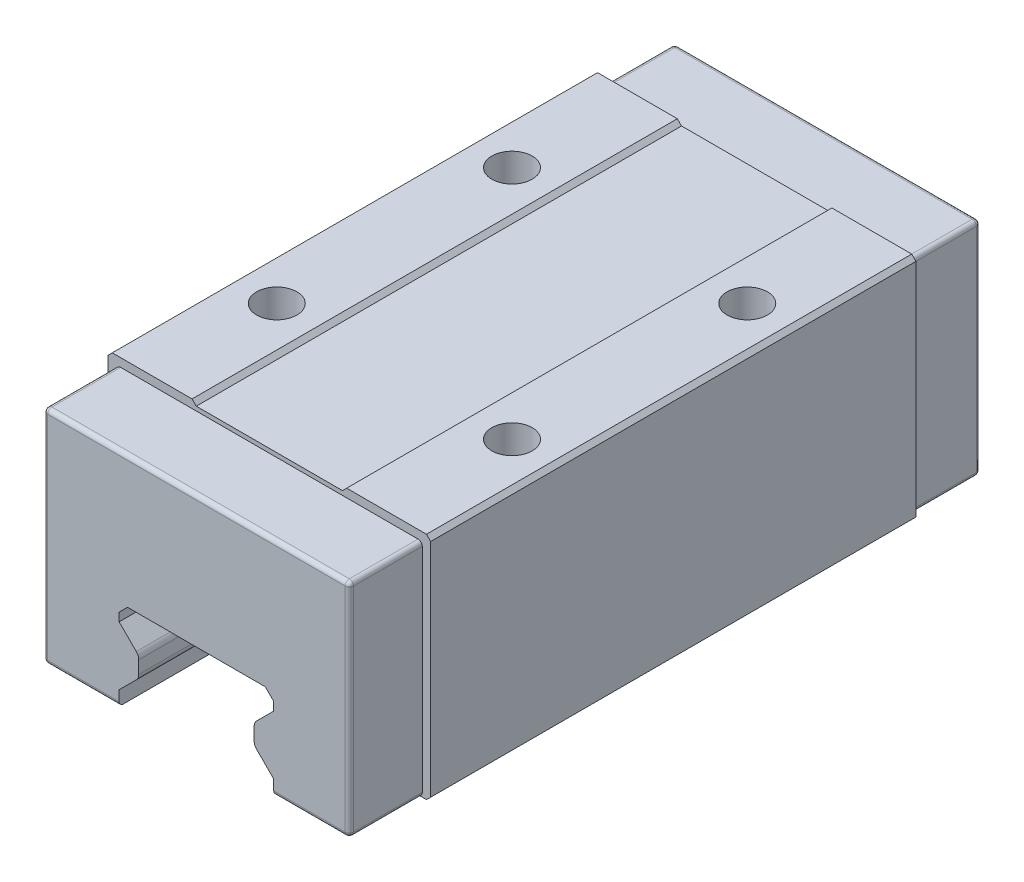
ISO-10303-21;
HEADER;
FILE_DESCRIPTION(('STEP AP214'),'2;1');
FILE_NAME('part.step','',(''),(''),'','','');
FILE_SCHEMA(('AUTOMOTIVE_DESIGN { 1 0 10303 214 1 1 1 1 }'));
ENDSEC;
DATA;
#1=APPLICATION_CONTEXT('core data for automotive mechanical design processes');
#2=APPLICATION_PROTOCOL_DEFINITION('international standard','automotive_design',2000,#1);
#3=PRODUCT_CONTEXT('',#1,'mechanical');
#4=PRODUCT('Part','Part','',(#3));
#5=PRODUCT_RELATED_PRODUCT_CATEGORY('part','',(#4));
#6=PRODUCT_DEFINITION_FORMATION('','',#4);
#7=PRODUCT_DEFINITION_CONTEXT('part definition',#1,'design');
#8=PRODUCT_DEFINITION('design','',#6,#7);
#9=PRODUCT_DEFINITION_SHAPE('','',#8);
#10=(LENGTH_UNIT() NAMED_UNIT(*) SI_UNIT(.MILLI.,.METRE.));
#11=(NAMED_UNIT(*) PLANE_ANGLE_UNIT() SI_UNIT($,.RADIAN.));
#12=(NAMED_UNIT(*) SI_UNIT($,.STERADIAN.) SOLID_ANGLE_UNIT());
#13=UNCERTAINTY_MEASURE_WITH_UNIT(LENGTH_MEASURE(1.E-05),#10,'distance_accuracy_value','');
#14=(GEOMETRIC_REPRESENTATION_CONTEXT(3) GLOBAL_UNCERTAINTY_ASSIGNED_CONTEXT((#13)) GLOBAL_UNIT_ASSIGNED_CONTEXT((#10,
#11,#12)) REPRESENTATION_CONTEXT('',''));
#15=CARTESIAN_POINT('',(0.,0.,0.));
#16=DIRECTION('',(0.,0.,1.));
#17=DIRECTION('',(1.,0.,0.));
#18=AXIS2_PLACEMENT_3D('',#15,#16,#17);
#19=CARTESIAN_POINT('',(-24.,40.,36.1));
#20=DIRECTION('',(0.,-1.,0.));
#21=DIRECTION('',(0.,0.,-1.));
#22=AXIS2_PLACEMENT_3D('',#19,#20,#21);
#23=PLANE('',#22);
#24=CARTESIAN_POINT('',(-17.5,40.,17.5));
#25=DIRECTION('',(0.,1.,0.));
#26=DIRECTION('',(-1.,0.,0.));
#27=AXIS2_PLACEMENT_3D('',#24,#25,#26);
#28=CIRCLE('',#27,3.);
#29=CARTESIAN_POINT('',(-20.5,40.,17.5));
#30=VERTEX_POINT('',#29);
#31=EDGE_CURVE('E1098',#30,#30,#28,.T.);
#32=ORIENTED_EDGE('',*,*,#31,.F.);
#33=EDGE_LOOP('',(#32));
#34=FACE_BOUND('',#33,.T.);
#35=CARTESIAN_POINT('',(-17.5,40.,-17.5));
#36=DIRECTION('',(0.,1.,0.));
#37=DIRECTION('',(-1.,0.,0.));
#38=AXIS2_PLACEMENT_3D('',#35,#36,#37);
#39=CIRCLE('',#38,3.);
#40=CARTESIAN_POINT('',(-20.5,40.,-17.5));
#41=VERTEX_POINT('',#40);
#42=EDGE_CURVE('E1076',#41,#41,#39,.T.);
#43=ORIENTED_EDGE('',*,*,#42,.F.);
#44=EDGE_LOOP('',(#43));
#45=FACE_BOUND('',#44,.T.);
#46=DIRECTION('',(-1.,0.,0.));
#47=VECTOR('',#46,1.);
#48=CARTESIAN_POINT('',(-24.,40.,-36.1));
#49=LINE('',#48,#47);
#50=CARTESIAN_POINT('',(-11.5,40.,-36.1));
#51=VERTEX_POINT('',#50);
#52=CARTESIAN_POINT('',(-23.375,40.,-36.1));
#53=VERTEX_POINT('',#52);
#54=EDGE_CURVE('E788',#51,#53,#49,.T.);
#55=ORIENTED_EDGE('',*,*,#54,.T.);
#56=DIRECTION('',(0.,0.,1.));
#57=VECTOR('',#56,1.);
#58=CARTESIAN_POINT('',(-23.375,40.,36.1));
#59=LINE('',#58,#57);
#60=CARTESIAN_POINT('',(-23.375,40.,36.1));
#61=VERTEX_POINT('',#60);
#62=EDGE_CURVE('E391',#53,#61,#59,.T.);
#63=ORIENTED_EDGE('',*,*,#62,.T.);
#64=DIRECTION('',(-1.,0.,0.));
#65=VECTOR('',#64,1.);
#66=CARTESIAN_POINT('',(-24.,40.,36.1));
#67=LINE('',#66,#65);
#68=CARTESIAN_POINT('',(-11.5,40.,36.1));
#69=VERTEX_POINT('',#68);
#70=EDGE_CURVE('E374',#69,#61,#67,.T.);
#71=ORIENTED_EDGE('',*,*,#70,.F.);
#72=DIRECTION('',(0.,0.,-1.));
#73=VECTOR('',#72,1.);
#74=CARTESIAN_POINT('',(-11.5,40.,36.1));
#75=LINE('',#74,#73);
#76=EDGE_CURVE('E388',#69,#51,#75,.T.);
#77=ORIENTED_EDGE('',*,*,#76,.T.);
#78=EDGE_LOOP('',(#55,#63,#71,#77));
#79=FACE_BOUND('',#78,.T.);
#80=ADVANCED_FACE('F39',(#34,#45,#79),#23,.F.);
#81=CARTESIAN_POINT('',(11.5,19.2,-46.95));
#82=DIRECTION('',(1.,0.,0.));
#83=DIRECTION('',(0.,1.,0.));
#84=AXIS2_PLACEMENT_3D('',#81,#82,#83);
#85=PLANE('',#84);
#86=DIRECTION('',(0.,-1.,0.));
#87=VECTOR('',#86,1.);
#88=CARTESIAN_POINT('',(11.5,0.,46.95));
#89=LINE('',#88,#87);
#90=CARTESIAN_POINT('',(11.5,17.95,46.95));
#91=VERTEX_POINT('',#90);
#92=CARTESIAN_POINT('',(11.5,16.7,46.95));
#93=VERTEX_POINT('',#92);
#94=EDGE_CURVE('E811',#91,#93,#89,.T.);
#95=ORIENTED_EDGE('',*,*,#94,.F.);
#96=DIRECTION('',(0.,0.,-1.));
#97=VECTOR('',#96,1.);
#98=CARTESIAN_POINT('',(11.5,17.95,-46.95));
#99=LINE('',#98,#97);
#100=CARTESIAN_POINT('',(11.5,17.95,-46.95));
#101=VERTEX_POINT('',#100);
#102=EDGE_CURVE('E821',#91,#101,#99,.T.);
#103=ORIENTED_EDGE('',*,*,#102,.T.);
#104=DIRECTION('',(0.,1.,0.));
#105=VECTOR('',#104,1.);
#106=CARTESIAN_POINT('',(11.5,19.2,-46.95));
#107=LINE('',#106,#105);
#108=CARTESIAN_POINT('',(11.5,16.7,-46.95));
#109=VERTEX_POINT('',#108);
#110=EDGE_CURVE('E946',#109,#101,#107,.T.);
#111=ORIENTED_EDGE('',*,*,#110,.F.);
#112=DIRECTION('',(0.,0.,1.));
#113=VECTOR('',#112,1.);
#114=CARTESIAN_POINT('',(11.5,16.7,-56.1733098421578));
#115=LINE('',#114,#113);
#116=EDGE_CURVE('E1058',#109,#93,#115,.T.);
#117=ORIENTED_EDGE('',*,*,#116,.T.);
#118=EDGE_LOOP('',(#95,#103,#111,#117));
#119=FACE_BOUND('',#118,.T.);
#120=ADVANCED_FACE('F1117',(#119),#85,.F.);
#121=CARTESIAN_POINT('',(-11.5,19.2,-46.95));
#122=DIRECTION('',(-1.,0.,0.));
#123=DIRECTION('',(0.,-1.,0.));
#124=AXIS2_PLACEMENT_3D('',#121,#122,#123);
#125=PLANE('',#124);
#126=DIRECTION('',(0.,-1.,0.));
#127=VECTOR('',#126,1.);
#128=CARTESIAN_POINT('',(-11.5,19.2,46.95));
#129=LINE('',#128,#127);
#130=CARTESIAN_POINT('',(-11.5,7.95,46.95));
#131=VERTEX_POINT('',#130);
#132=CARTESIAN_POINT('',(-11.5,6.425,46.95));
#133=VERTEX_POINT('',#132);
#134=EDGE_CURVE('E955',#131,#133,#129,.T.);
#135=ORIENTED_EDGE('',*,*,#134,.T.);
#136=CARTESIAN_POINT('',(-11.5,6.425,46.325));
#137=DIRECTION('',(-1.,0.,0.));
#138=DIRECTION('',(0.,-1.,0.));
#139=AXIS2_PLACEMENT_3D('',#136,#137,#138);
#140=CIRCLE('',#139,0.625);
#141=CARTESIAN_POINT('',(-11.5,5.8,46.325));
#142=VERTEX_POINT('',#141);
#143=EDGE_CURVE('E560',#133,#142,#140,.F.);
#144=ORIENTED_EDGE('',*,*,#143,.T.);
#145=DIRECTION('',(0.,0.,1.));
#146=VECTOR('',#145,1.);
#147=CARTESIAN_POINT('',(-11.5,5.8,36.1));
#148=LINE('',#147,#146);
#149=CARTESIAN_POINT('',(-11.5,5.8,-46.325));
#150=VERTEX_POINT('',#149);
#151=EDGE_CURVE('E751',#150,#142,#148,.T.);
#152=ORIENTED_EDGE('',*,*,#151,.F.);
#153=CARTESIAN_POINT('',(-11.5,6.425,-46.325));
#154=DIRECTION('',(-1.,0.,0.));
#155=DIRECTION('',(0.,-1.,0.));
#156=AXIS2_PLACEMENT_3D('',#153,#154,#155);
#157=CIRCLE('',#156,0.625);
#158=CARTESIAN_POINT('',(-11.5,6.425,-46.95));
#159=VERTEX_POINT('',#158);
#160=EDGE_CURVE('E557',#150,#159,#157,.F.);
#161=ORIENTED_EDGE('',*,*,#160,.T.);
#162=DIRECTION('',(0.,-1.,0.));
#163=VECTOR('',#162,1.);
#164=CARTESIAN_POINT('',(-11.5,19.2,-46.95));
#165=LINE('',#164,#163);
#166=CARTESIAN_POINT('',(-11.5,7.95,-46.95));
#167=VERTEX_POINT('',#166);
#168=EDGE_CURVE('E950',#167,#159,#165,.T.);
#169=ORIENTED_EDGE('',*,*,#168,.F.);
#170=DIRECTION('',(0.,0.,1.));
#171=VECTOR('',#170,1.);
#172=CARTESIAN_POINT('',(-11.5,7.95,-56.1733098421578));
#173=LINE('',#172,#171);
#174=EDGE_CURVE('E919',#167,#131,#173,.T.);
#175=ORIENTED_EDGE('',*,*,#174,.T.);
#176=EDGE_LOOP('',(#135,#144,#152,#161,#169,#175));
#177=FACE_BOUND('',#176,.T.);
#178=ADVANCED_FACE('F968',(#177),#125,.F.);
#179=CARTESIAN_POINT('',(-24.,5.8,36.1));
#180=DIRECTION('',(0.,1.,0.));
#181=DIRECTION('',(-1.,0.,0.));
#182=AXIS2_PLACEMENT_3D('',#179,#180,#181);
#183=PLANE('',#182);
#184=DIRECTION('',(0.,0.,-1.));
#185=VECTOR('',#184,1.);
#186=CARTESIAN_POINT('',(22.125,5.8,36.1));
#187=LINE('',#186,#185);
#188=CARTESIAN_POINT('',(22.125,5.8,36.1));
#189=VERTEX_POINT('',#188);
#190=CARTESIAN_POINT('',(22.125,5.8,46.325));
#191=VERTEX_POINT('',#190);
#192=EDGE_CURVE('E506',#189,#191,#187,.F.);
#193=ORIENTED_EDGE('',*,*,#192,.T.);
#194=DIRECTION('',(1.,0.,0.));
#195=VECTOR('',#194,1.);
#196=CARTESIAN_POINT('',(-24.,5.8,46.325));
#197=LINE('',#196,#195);
#198=CARTESIAN_POINT('',(11.5,5.8,46.325));
#199=VERTEX_POINT('',#198);
#200=EDGE_CURVE('E509',#191,#199,#197,.F.);
#201=ORIENTED_EDGE('',*,*,#200,.T.);
#202=DIRECTION('',(0.,0.,-1.));
#203=VECTOR('',#202,1.);
#204=CARTESIAN_POINT('',(11.5,5.8,36.1));
#205=LINE('',#204,#203);
#206=CARTESIAN_POINT('',(11.5,5.8,-46.325));
#207=VERTEX_POINT('',#206);
#208=EDGE_CURVE('E744',#199,#207,#205,.T.);
#209=ORIENTED_EDGE('',*,*,#208,.T.);
#210=DIRECTION('',(1.,0.,0.));
#211=VECTOR('',#210,1.);
#212=CARTESIAN_POINT('',(22.75,5.8,-46.325));
#213=LINE('',#212,#211);
#214=CARTESIAN_POINT('',(22.125,5.8,-46.325));
#215=VERTEX_POINT('',#214);
#216=EDGE_CURVE('E503',#207,#215,#213,.T.);
#217=ORIENTED_EDGE('',*,*,#216,.T.);
#218=DIRECTION('',(0.,0.,-1.));
#219=VECTOR('',#218,1.);
#220=CARTESIAN_POINT('',(22.125,5.8,36.1));
#221=LINE('',#220,#219);
#222=CARTESIAN_POINT('',(22.125,5.8,-36.1));
#223=VERTEX_POINT('',#222);
#224=EDGE_CURVE('E499',#215,#223,#221,.F.);
#225=ORIENTED_EDGE('',*,*,#224,.T.);
#226=DIRECTION('',(1.,0.,0.));
#227=VECTOR('',#226,1.);
#228=CARTESIAN_POINT('',(-24.,5.8,-36.1));
#229=LINE('',#228,#227);
#230=CARTESIAN_POINT('',(23.375,5.8,-36.1));
#231=VERTEX_POINT('',#230);
#232=EDGE_CURVE('E797',#223,#231,#229,.T.);
#233=ORIENTED_EDGE('',*,*,#232,.T.);
#234=DIRECTION('',(0.,0.,1.));
#235=VECTOR('',#234,1.);
#236=CARTESIAN_POINT('',(23.375,5.8,36.1));
#237=LINE('',#236,#235);
#238=CARTESIAN_POINT('',(23.375,5.8,36.1));
#239=VERTEX_POINT('',#238);
#240=EDGE_CURVE('E448',#231,#239,#237,.T.);
#241=ORIENTED_EDGE('',*,*,#240,.T.);
#242=DIRECTION('',(1.,0.,0.));
#243=VECTOR('',#242,1.);
#244=CARTESIAN_POINT('',(-24.,5.8,36.1));
#245=LINE('',#244,#243);
#246=EDGE_CURVE('E780',#189,#239,#245,.T.);
#247=ORIENTED_EDGE('',*,*,#246,.F.);
#248=EDGE_LOOP('',(#193,#201,#209,#217,#225,#233,#241,#247));
#249=FACE_BOUND('',#248,.T.);
#250=ADVANCED_FACE('F743',(#249),#183,.F.);
#251=CARTESIAN_POINT('',(0.,0.,36.1));
#252=DIRECTION('',(0.,0.,-1.));
#253=DIRECTION('',(-1.,0.,0.));
#254=AXIS2_PLACEMENT_3D('',#251,#252,#253);
#255=PLANE('',#254);
#256=DIRECTION('',(0.,1.,0.));
#257=VECTOR('',#256,1.);
#258=CARTESIAN_POINT('',(24.,5.8,36.1));
#259=LINE('',#258,#257);
#260=CARTESIAN_POINT('',(24.,6.42500000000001,36.1));
#261=VERTEX_POINT('',#260);
#262=CARTESIAN_POINT('',(24.,39.375,36.1));
#263=VERTEX_POINT('',#262);
#264=EDGE_CURVE('E394',#261,#263,#259,.T.);
#265=ORIENTED_EDGE('',*,*,#264,.T.);
#266=DIRECTION('',(0.707106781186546,-0.707106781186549,0.));
#267=VECTOR('',#266,1.);
#268=CARTESIAN_POINT('',(23.375,40.,36.1));
#269=LINE('',#268,#267);
#270=CARTESIAN_POINT('',(23.375,40.,36.1));
#271=VERTEX_POINT('',#270);
#272=EDGE_CURVE('E445',#263,#271,#269,.F.);
#273=ORIENTED_EDGE('',*,*,#272,.T.);
#274=CARTESIAN_POINT('',(11.5,40.,36.1));
#275=VERTEX_POINT('',#274);
#276=EDGE_CURVE('E393',#271,#275,#67,.T.);
#277=ORIENTED_EDGE('',*,*,#276,.T.);
#278=DIRECTION('',(0.70710678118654,0.707106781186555,0.));
#279=VECTOR('',#278,1.);
#280=CARTESIAN_POINT('',(-14.2499999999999,14.2499999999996,36.1));
#281=LINE('',#280,#279);
#282=CARTESIAN_POINT('',(10.875,39.375,36.1));
#283=VERTEX_POINT('',#282);
#284=EDGE_CURVE('E469',#275,#283,#281,.F.);
#285=ORIENTED_EDGE('',*,*,#284,.T.);
#286=DIRECTION('',(1.,0.,0.));
#287=VECTOR('',#286,1.);
#288=CARTESIAN_POINT('',(-11.5,39.375,36.1));
#289=LINE('',#288,#287);
#290=CARTESIAN_POINT('',(-10.875,39.375,36.1));
#291=VERTEX_POINT('',#290);
#292=EDGE_CURVE('E377',#291,#283,#289,.T.);
#293=ORIENTED_EDGE('',*,*,#292,.F.);
#294=DIRECTION('',(0.707106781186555,-0.70710678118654,0.));
#295=VECTOR('',#294,1.);
#296=CARTESIAN_POINT('',(14.2500000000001,14.2500000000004,36.1));
#297=LINE('',#296,#295);
#298=EDGE_CURVE('E370',#291,#69,#297,.F.);
#299=ORIENTED_EDGE('',*,*,#298,.T.);
#300=ORIENTED_EDGE('',*,*,#70,.T.);
#301=DIRECTION('',(0.707106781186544,0.707106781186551,0.));
#302=VECTOR('',#301,1.);
#303=CARTESIAN_POINT('',(-24.,39.375,36.1));
#304=LINE('',#303,#302);
#305=CARTESIAN_POINT('',(-24.,39.375,36.1));
#306=VERTEX_POINT('',#305);
#307=EDGE_CURVE('E436',#61,#306,#304,.F.);
#308=ORIENTED_EDGE('',*,*,#307,.T.);
#309=DIRECTION('',(0.,-1.,0.));
#310=VECTOR('',#309,1.);
#311=CARTESIAN_POINT('',(-24.,5.8,36.1));
#312=LINE('',#311,#310);
#313=CARTESIAN_POINT('',(-24.,6.42500000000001,36.1));
#314=VERTEX_POINT('',#313);
#315=EDGE_CURVE('E776',#306,#314,#312,.T.);
#316=ORIENTED_EDGE('',*,*,#315,.T.);
#317=DIRECTION('',(-0.707106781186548,0.707106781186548,0.));
#318=VECTOR('',#317,1.);
#319=CARTESIAN_POINT('',(-23.375,5.8,36.1));
#320=LINE('',#319,#318);
#321=CARTESIAN_POINT('',(-23.375,5.8,36.1));
#322=VERTEX_POINT('',#321);
#323=EDGE_CURVE('E439',#314,#322,#320,.F.);
#324=ORIENTED_EDGE('',*,*,#323,.T.);
#325=CARTESIAN_POINT('',(-22.125,5.8,36.1));
#326=VERTEX_POINT('',#325);
#327=EDGE_CURVE('E781',#322,#326,#245,.T.);
#328=ORIENTED_EDGE('',*,*,#327,.T.);
#329=CARTESIAN_POINT('',(-22.125,6.425,36.1));
#330=DIRECTION('',(0.,0.,-1.));
#331=DIRECTION('',(-1.,0.,0.));
#332=AXIS2_PLACEMENT_3D('',#329,#330,#331);
#333=CIRCLE('',#332,0.625);
#334=CARTESIAN_POINT('',(-22.75,6.425,36.1));
#335=VERTEX_POINT('',#334);
#336=EDGE_CURVE('E601',#326,#335,#333,.T.);
#337=ORIENTED_EDGE('',*,*,#336,.T.);
#338=DIRECTION('',(0.,-1.,0.));
#339=VECTOR('',#338,1.);
#340=CARTESIAN_POINT('',(-22.75,0.,36.1));
#341=LINE('',#340,#339);
#342=CARTESIAN_POINT('',(-22.75,38.125,36.1));
#343=VERTEX_POINT('',#342);
#344=EDGE_CURVE('E766',#343,#335,#341,.T.);
#345=ORIENTED_EDGE('',*,*,#344,.F.);
#346=CARTESIAN_POINT('',(-22.125,38.125,36.1));
#347=DIRECTION('',(0.,0.,-1.));
#348=DIRECTION('',(-1.,0.,0.));
#349=AXIS2_PLACEMENT_3D('',#346,#347,#348);
#350=CIRCLE('',#349,0.625);
#351=CARTESIAN_POINT('',(-22.125,38.75,36.1));
#352=VERTEX_POINT('',#351);
#353=EDGE_CURVE('E607',#343,#352,#350,.T.);
#354=ORIENTED_EDGE('',*,*,#353,.T.);
#355=DIRECTION('',(-1.,0.,0.));
#356=VECTOR('',#355,1.);
#357=CARTESIAN_POINT('',(0.,38.75,36.1));
#358=LINE('',#357,#356);
#359=CARTESIAN_POINT('',(22.125,38.75,36.1));
#360=VERTEX_POINT('',#359);
#361=EDGE_CURVE('E750',#360,#352,#358,.T.);
#362=ORIENTED_EDGE('',*,*,#361,.F.);
#363=CARTESIAN_POINT('',(22.125,38.125,36.1));
#364=DIRECTION('',(0.,0.,-1.));
#365=DIRECTION('',(-1.,0.,0.));
#366=AXIS2_PLACEMENT_3D('',#363,#364,#365);
#367=CIRCLE('',#366,0.625);
#368=CARTESIAN_POINT('',(22.75,38.125,36.1));
#369=VERTEX_POINT('',#368);
#370=EDGE_CURVE('E610',#360,#369,#367,.T.);
#371=ORIENTED_EDGE('',*,*,#370,.T.);
#372=DIRECTION('',(0.,1.,0.));
#373=VECTOR('',#372,1.);
#374=CARTESIAN_POINT('',(22.75,0.,36.1));
#375=LINE('',#374,#373);
#376=CARTESIAN_POINT('',(22.75,6.425,36.1));
#377=VERTEX_POINT('',#376);
#378=EDGE_CURVE('E755',#377,#369,#375,.T.);
#379=ORIENTED_EDGE('',*,*,#378,.F.);
#380=CARTESIAN_POINT('',(22.125,6.425,36.1));
#381=DIRECTION('',(0.,0.,-1.));
#382=DIRECTION('',(-1.,0.,0.));
#383=AXIS2_PLACEMENT_3D('',#380,#381,#382);
#384=CIRCLE('',#383,0.625);
#385=EDGE_CURVE('E604',#377,#189,#384,.T.);
#386=ORIENTED_EDGE('',*,*,#385,.T.);
#387=ORIENTED_EDGE('',*,*,#246,.T.);
#388=DIRECTION('',(-0.70710678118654,-0.707106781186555,0.));
#389=VECTOR('',#388,1.);
#390=CARTESIAN_POINT('',(24.,6.42500000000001,36.1));
#391=LINE('',#390,#389);
#392=EDGE_CURVE('E442',#239,#261,#391,.F.);
#393=ORIENTED_EDGE('',*,*,#392,.T.);
#394=EDGE_LOOP('',(#265,#273,#277,#285,#293,#299,#300,#308,#316,#324,#328,#337,#345,#354,#362,
#371,#379,#386,#387,#393));
#395=FACE_BOUND('',#394,.T.);
#396=ADVANCED_FACE('F373',(#395),#255,.F.);
#397=CARTESIAN_POINT('',(0.,0.,-36.1));
#398=DIRECTION('',(0.,0.,-1.));
#399=DIRECTION('',(-1.,0.,0.));
#400=AXIS2_PLACEMENT_3D('',#397,#398,#399);
#401=PLANE('',#400);
#402=CARTESIAN_POINT('',(23.375,40.,-36.1));
#403=VERTEX_POINT('',#402);
#404=CARTESIAN_POINT('',(11.5,40.,-36.1));
#405=VERTEX_POINT('',#404);
#406=EDGE_CURVE('E789',#403,#405,#49,.T.);
#407=ORIENTED_EDGE('',*,*,#406,.F.);
#408=DIRECTION('',(-0.707106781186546,0.707106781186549,0.));
#409=VECTOR('',#408,1.);
#410=CARTESIAN_POINT('',(31.6875000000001,31.6874999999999,-36.1));
#411=LINE('',#410,#409);
#412=CARTESIAN_POINT('',(24.,39.375,-36.1));
#413=VERTEX_POINT('',#412);
#414=EDGE_CURVE('E426',#403,#413,#411,.F.);
#415=ORIENTED_EDGE('',*,*,#414,.T.);
#416=DIRECTION('',(0.,1.,0.));
#417=VECTOR('',#416,1.);
#418=CARTESIAN_POINT('',(24.,5.8,-36.1));
#419=LINE('',#418,#417);
#420=CARTESIAN_POINT('',(24.,6.42500000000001,-36.1));
#421=VERTEX_POINT('',#420);
#422=EDGE_CURVE('E770',#421,#413,#419,.T.);
#423=ORIENTED_EDGE('',*,*,#422,.F.);
#424=DIRECTION('',(0.70710678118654,0.707106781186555,0.));
#425=VECTOR('',#424,1.);
#426=CARTESIAN_POINT('',(8.78750000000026,-8.78750000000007,-36.1));
#427=LINE('',#426,#425);
#428=EDGE_CURVE('E423',#421,#231,#427,.F.);
#429=ORIENTED_EDGE('',*,*,#428,.T.);
#430=ORIENTED_EDGE('',*,*,#232,.F.);
#431=CARTESIAN_POINT('',(22.125,6.425,-36.1));
#432=DIRECTION('',(0.,0.,-1.));
#433=DIRECTION('',(-1.,0.,0.));
#434=AXIS2_PLACEMENT_3D('',#431,#432,#433);
#435=CIRCLE('',#434,0.625);
#436=CARTESIAN_POINT('',(22.75,6.425,-36.1));
#437=VERTEX_POINT('',#436);
#438=EDGE_CURVE('E613',#223,#437,#435,.F.);
#439=ORIENTED_EDGE('',*,*,#438,.T.);
#440=DIRECTION('',(0.,1.,0.));
#441=VECTOR('',#440,1.);
#442=CARTESIAN_POINT('',(22.75,0.,-36.1));
#443=LINE('',#442,#441);
#444=CARTESIAN_POINT('',(22.75,38.125,-36.1));
#445=VERTEX_POINT('',#444);
#446=EDGE_CURVE('E803',#437,#445,#443,.T.);
#447=ORIENTED_EDGE('',*,*,#446,.T.);
#448=CARTESIAN_POINT('',(22.125,38.125,-36.1));
#449=DIRECTION('',(0.,0.,-1.));
#450=DIRECTION('',(-1.,0.,0.));
#451=AXIS2_PLACEMENT_3D('',#448,#449,#450);
#452=CIRCLE('',#451,0.625);
#453=CARTESIAN_POINT('',(22.125,38.75,-36.1));
#454=VERTEX_POINT('',#453);
#455=EDGE_CURVE('E49',#445,#454,#452,.F.);
#456=ORIENTED_EDGE('',*,*,#455,.T.);
#457=DIRECTION('',(-1.,0.,0.));
#458=VECTOR('',#457,1.);
#459=CARTESIAN_POINT('',(0.,38.75,-36.1));
#460=LINE('',#459,#458);
#461=CARTESIAN_POINT('',(-22.125,38.75,-36.1));
#462=VERTEX_POINT('',#461);
#463=EDGE_CURVE('E784',#454,#462,#460,.T.);
#464=ORIENTED_EDGE('',*,*,#463,.T.);
#465=CARTESIAN_POINT('',(-22.125,38.125,-36.1));
#466=DIRECTION('',(0.,0.,-1.));
#467=DIRECTION('',(-1.,0.,0.));
#468=AXIS2_PLACEMENT_3D('',#465,#466,#467);
#469=CIRCLE('',#468,0.625);
#470=CARTESIAN_POINT('',(-22.75,38.125,-36.1));
#471=VERTEX_POINT('',#470);
#472=EDGE_CURVE('E11',#462,#471,#469,.F.);
#473=ORIENTED_EDGE('',*,*,#472,.T.);
#474=DIRECTION('',(0.,-1.,0.));
#475=VECTOR('',#474,1.);
#476=CARTESIAN_POINT('',(-22.75,0.,-36.1));
#477=LINE('',#476,#475);
#478=CARTESIAN_POINT('',(-22.75,6.425,-36.1));
#479=VERTEX_POINT('',#478);
#480=EDGE_CURVE('E807',#471,#479,#477,.T.);
#481=ORIENTED_EDGE('',*,*,#480,.T.);
#482=CARTESIAN_POINT('',(-22.125,6.425,-36.1));
#483=DIRECTION('',(0.,0.,-1.));
#484=DIRECTION('',(-1.,0.,0.));
#485=AXIS2_PLACEMENT_3D('',#482,#483,#484);
#486=CIRCLE('',#485,0.625);
#487=CARTESIAN_POINT('',(-22.125,5.8,-36.1));
#488=VERTEX_POINT('',#487);
#489=EDGE_CURVE('E597',#479,#488,#486,.F.);
#490=ORIENTED_EDGE('',*,*,#489,.T.);
#491=CARTESIAN_POINT('',(-23.375,5.8,-36.1));
#492=VERTEX_POINT('',#491);
#493=EDGE_CURVE('E772',#492,#488,#229,.T.);
#494=ORIENTED_EDGE('',*,*,#493,.F.);
#495=DIRECTION('',(0.707106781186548,-0.707106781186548,0.));
#496=VECTOR('',#495,1.);
#497=CARTESIAN_POINT('',(-8.78749999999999,-8.78749999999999,-36.1));
#498=LINE('',#497,#496);
#499=CARTESIAN_POINT('',(-24.,6.42500000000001,-36.1));
#500=VERTEX_POINT('',#499);
#501=EDGE_CURVE('E420',#492,#500,#498,.F.);
#502=ORIENTED_EDGE('',*,*,#501,.T.);
#503=DIRECTION('',(0.,-1.,0.));
#504=VECTOR('',#503,1.);
#505=CARTESIAN_POINT('',(-24.,5.8,-36.1));
#506=LINE('',#505,#504);
#507=CARTESIAN_POINT('',(-24.,39.375,-36.1));
#508=VERTEX_POINT('',#507);
#509=EDGE_CURVE('E793',#508,#500,#506,.T.);
#510=ORIENTED_EDGE('',*,*,#509,.F.);
#511=DIRECTION('',(-0.707106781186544,-0.707106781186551,0.));
#512=VECTOR('',#511,1.);
#513=CARTESIAN_POINT('',(-31.6875000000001,31.6874999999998,-36.1));
#514=LINE('',#513,#512);
#515=EDGE_CURVE('E417',#508,#53,#514,.F.);
#516=ORIENTED_EDGE('',*,*,#515,.T.);
#517=ORIENTED_EDGE('',*,*,#54,.F.);
#518=DIRECTION('',(-0.707106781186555,0.70710678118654,0.));
#519=VECTOR('',#518,1.);
#520=CARTESIAN_POINT('',(-10.875,39.375,-36.1));
#521=LINE('',#520,#519);
#522=CARTESIAN_POINT('',(-10.875,39.375,-36.1));
#523=VERTEX_POINT('',#522);
#524=EDGE_CURVE('E383',#51,#523,#521,.F.);
#525=ORIENTED_EDGE('',*,*,#524,.T.);
#526=DIRECTION('',(-1.,0.,0.));
#527=VECTOR('',#526,1.);
#528=CARTESIAN_POINT('',(0.,39.375,-36.1));
#529=LINE('',#528,#527);
#530=CARTESIAN_POINT('',(10.875,39.375,-36.1));
#531=VERTEX_POINT('',#530);
#532=EDGE_CURVE('E399',#531,#523,#529,.T.);
#533=ORIENTED_EDGE('',*,*,#532,.F.);
#534=DIRECTION('',(-0.70710678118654,-0.707106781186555,0.));
#535=VECTOR('',#534,1.);
#536=CARTESIAN_POINT('',(11.5,40.,-36.1));
#537=LINE('',#536,#535);
#538=EDGE_CURVE('E384',#531,#405,#537,.F.);
#539=ORIENTED_EDGE('',*,*,#538,.T.);
#540=EDGE_LOOP('',(#407,#415,#423,#429,#430,#439,#447,#456,#464,#473,#481,#490,#494,#502,#510,
#516,#517,#525,#533,#539));
#541=FACE_BOUND('',#540,.T.);
#542=ADVANCED_FACE('F1024',(#541),#401,.T.);
#543=CARTESIAN_POINT('',(24.,5.8,36.1));
#544=DIRECTION('',(-1.,0.,0.));
#545=DIRECTION('',(0.,-1.,0.));
#546=AXIS2_PLACEMENT_3D('',#543,#544,#545);
#547=PLANE('',#546);
#548=ORIENTED_EDGE('',*,*,#422,.T.);
#549=DIRECTION('',(0.,0.,1.));
#550=VECTOR('',#549,1.);
#551=CARTESIAN_POINT('',(24.,39.375,36.1));
#552=LINE('',#551,#550);
#553=EDGE_CURVE('E433',#413,#263,#552,.T.);
#554=ORIENTED_EDGE('',*,*,#553,.T.);
#555=ORIENTED_EDGE('',*,*,#264,.F.);
#556=DIRECTION('',(0.,0.,-1.));
#557=VECTOR('',#556,1.);
#558=CARTESIAN_POINT('',(24.,6.42500000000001,36.1));
#559=LINE('',#558,#557);
#560=EDGE_CURVE('E429',#261,#421,#559,.T.);
#561=ORIENTED_EDGE('',*,*,#560,.T.);
#562=EDGE_LOOP('',(#548,#554,#555,#561));
#563=FACE_BOUND('',#562,.T.);
#564=ADVANCED_FACE('F1193',(#563),#547,.F.);
#565=CARTESIAN_POINT('',(17.5,40.,-17.5));
#566=DIRECTION('',(0.,1.,0.));
#567=DIRECTION('',(-1.,0.,0.));
#568=AXIS2_PLACEMENT_3D('',#565,#566,#567);
#569=CIRCLE('',#568,3.);
#570=CARTESIAN_POINT('',(14.5,40.,-17.5));
#571=VERTEX_POINT('',#570);
#572=EDGE_CURVE('E1083',#571,#571,#569,.T.);
#573=ORIENTED_EDGE('',*,*,#572,.F.);
#574=EDGE_LOOP('',(#573));
#575=FACE_BOUND('',#574,.T.);
#576=CARTESIAN_POINT('',(17.5,40.,17.5));
#577=DIRECTION('',(0.,1.,0.));
#578=DIRECTION('',(-1.,0.,0.));
#579=AXIS2_PLACEMENT_3D('',#576,#577,#578);
#580=CIRCLE('',#579,3.);
#581=CARTESIAN_POINT('',(14.5,40.,17.5));
#582=VERTEX_POINT('',#581);
#583=EDGE_CURVE('E1091',#582,#582,#580,.T.);
#584=ORIENTED_EDGE('',*,*,#583,.F.);
#585=EDGE_LOOP('',(#584));
#586=FACE_BOUND('',#585,.T.);
#587=ORIENTED_EDGE('',*,*,#276,.F.);
#588=DIRECTION('',(0.,0.,-1.));
#589=VECTOR('',#588,1.);
#590=CARTESIAN_POINT('',(23.375,40.,36.1));
#591=LINE('',#590,#589);
#592=EDGE_CURVE('E406',#271,#403,#591,.T.);
#593=ORIENTED_EDGE('',*,*,#592,.T.);
#594=ORIENTED_EDGE('',*,*,#406,.T.);
#595=DIRECTION('',(0.,0.,1.));
#596=VECTOR('',#595,1.);
#597=CARTESIAN_POINT('',(11.5,40.,36.1));
#598=LINE('',#597,#596);
#599=EDGE_CURVE('E400',#405,#275,#598,.T.);
#600=ORIENTED_EDGE('',*,*,#599,.T.);
#601=EDGE_LOOP('',(#587,#593,#594,#600));
#602=FACE_BOUND('',#601,.T.);
#603=ADVANCED_FACE('F1119',(#575,#586,#602),#23,.F.);
#604=CARTESIAN_POINT('',(-24.,5.8,36.1));
#605=DIRECTION('',(1.,0.,0.));
#606=DIRECTION('',(0.,0.,-1.));
#607=AXIS2_PLACEMENT_3D('',#604,#605,#606);
#608=PLANE('',#607);
#609=ORIENTED_EDGE('',*,*,#509,.T.);
#610=DIRECTION('',(0.,0.,1.));
#611=VECTOR('',#610,1.);
#612=CARTESIAN_POINT('',(-24.,6.42500000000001,36.1));
#613=LINE('',#612,#611);
#614=EDGE_CURVE('E459',#500,#314,#613,.T.);
#615=ORIENTED_EDGE('',*,*,#614,.T.);
#616=ORIENTED_EDGE('',*,*,#315,.F.);
#617=DIRECTION('',(0.,0.,-1.));
#618=VECTOR('',#617,1.);
#619=CARTESIAN_POINT('',(-24.,39.375,36.1));
#620=LINE('',#619,#618);
#621=EDGE_CURVE('E455',#306,#508,#620,.T.);
#622=ORIENTED_EDGE('',*,*,#621,.T.);
#623=EDGE_LOOP('',(#609,#615,#616,#622));
#624=FACE_BOUND('',#623,.T.);
#625=ADVANCED_FACE('F1196',(#624),#608,.F.);
#626=DIRECTION('',(0.,0.,-1.));
#627=VECTOR('',#626,1.);
#628=CARTESIAN_POINT('',(-22.125,5.8,36.1));
#629=LINE('',#628,#627);
#630=CARTESIAN_POINT('',(-22.125,5.8,46.325));
#631=VERTEX_POINT('',#630);
#632=EDGE_CURVE('E486',#631,#326,#629,.T.);
#633=ORIENTED_EDGE('',*,*,#632,.T.);
#634=ORIENTED_EDGE('',*,*,#327,.F.);
#635=DIRECTION('',(0.,0.,-1.));
#636=VECTOR('',#635,1.);
#637=CARTESIAN_POINT('',(-23.375,5.8,36.1));
#638=LINE('',#637,#636);
#639=EDGE_CURVE('E451',#322,#492,#638,.T.);
#640=ORIENTED_EDGE('',*,*,#639,.T.);
#641=ORIENTED_EDGE('',*,*,#493,.T.);
#642=DIRECTION('',(0.,0.,-1.));
#643=VECTOR('',#642,1.);
#644=CARTESIAN_POINT('',(-22.125,5.8,36.1));
#645=LINE('',#644,#643);
#646=CARTESIAN_POINT('',(-22.125,5.8,-46.325));
#647=VERTEX_POINT('',#646);
#648=EDGE_CURVE('E479',#488,#647,#645,.T.);
#649=ORIENTED_EDGE('',*,*,#648,.T.);
#650=DIRECTION('',(1.,0.,0.));
#651=VECTOR('',#650,1.);
#652=CARTESIAN_POINT('',(-11.5,5.8,-46.325));
#653=LINE('',#652,#651);
#654=EDGE_CURVE('E476',#647,#150,#653,.T.);
#655=ORIENTED_EDGE('',*,*,#654,.T.);
#656=ORIENTED_EDGE('',*,*,#151,.T.);
#657=DIRECTION('',(1.,0.,0.));
#658=VECTOR('',#657,1.);
#659=CARTESIAN_POINT('',(-24.,5.8,46.325));
#660=LINE('',#659,#658);
#661=EDGE_CURVE('E483',#142,#631,#660,.F.);
#662=ORIENTED_EDGE('',*,*,#661,.T.);
#663=EDGE_LOOP('',(#633,#634,#640,#641,#649,#655,#656,#662));
#664=FACE_BOUND('',#663,.T.);
#665=ADVANCED_FACE('F980',(#664),#183,.F.);
#666=CARTESIAN_POINT('',(0.,0.,-46.95));
#667=DIRECTION('',(0.,0.,-1.));
#668=DIRECTION('',(-1.,0.,0.));
#669=AXIS2_PLACEMENT_3D('',#666,#667,#668);
#670=PLANE('',#669);
#671=DIRECTION('',(0.,1.,0.));
#672=VECTOR('',#671,1.);
#673=CARTESIAN_POINT('',(22.125,5.8,-46.95));
#674=LINE('',#673,#672);
#675=CARTESIAN_POINT('',(22.125,38.125,-46.95));
#676=VERTEX_POINT('',#675);
#677=CARTESIAN_POINT('',(22.125,6.425,-46.95));
#678=VERTEX_POINT('',#677);
#679=EDGE_CURVE('E521',#676,#678,#674,.F.);
#680=ORIENTED_EDGE('',*,*,#679,.T.);
#681=DIRECTION('',(1.,0.,0.));
#682=VECTOR('',#681,1.);
#683=CARTESIAN_POINT('',(11.5,6.425,-46.95));
#684=LINE('',#683,#682);
#685=CARTESIAN_POINT('',(11.5,6.425,-46.95));
#686=VERTEX_POINT('',#685);
#687=EDGE_CURVE('E524',#678,#686,#684,.F.);
#688=ORIENTED_EDGE('',*,*,#687,.T.);
#689=CARTESIAN_POINT('',(11.5,7.95,-46.95));
#690=VERTEX_POINT('',#689);
#691=EDGE_CURVE('E942',#686,#690,#107,.T.);
#692=ORIENTED_EDGE('',*,*,#691,.T.);
#693=DIRECTION('',(0.707106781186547,-0.707106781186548,0.));
#694=VECTOR('',#693,1.);
#695=CARTESIAN_POINT('',(11.5,7.95,-46.95));
#696=LINE('',#695,#694);
#697=CARTESIAN_POINT('',(8.94944985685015,10.5005501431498,-46.95));
#698=VERTEX_POINT('',#697);
#699=EDGE_CURVE('E1043',#698,#690,#696,.T.);
#700=ORIENTED_EDGE('',*,*,#699,.F.);
#701=CARTESIAN_POINT('',(9.83333333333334,11.384433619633,-46.95));
#702=DIRECTION('',(0.,0.,-1.));
#703=DIRECTION('',(-1.,0.,0.));
#704=AXIS2_PLACEMENT_3D('',#701,#702,#703);
#705=CIRCLE('',#704,1.25);
#706=CARTESIAN_POINT('',(8.58333333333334,11.384433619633,-46.95));
#707=VERTEX_POINT('',#706);
#708=EDGE_CURVE('E871',#698,#707,#705,.T.);
#709=ORIENTED_EDGE('',*,*,#708,.T.);
#710=DIRECTION('',(0.,-1.,0.));
#711=VECTOR('',#710,1.);
#712=CARTESIAN_POINT('',(8.58333333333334,10.8666666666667,-46.95));
#713=LINE('',#712,#711);
#714=CARTESIAN_POINT('',(8.58333333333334,13.265566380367,-46.95));
#715=VERTEX_POINT('',#714);
#716=EDGE_CURVE('E1045',#715,#707,#713,.T.);
#717=ORIENTED_EDGE('',*,*,#716,.F.);
#718=CARTESIAN_POINT('',(9.83333333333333,13.265566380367,-46.95));
#719=DIRECTION('',(0.,0.,-1.));
#720=DIRECTION('',(-1.,0.,0.));
#721=AXIS2_PLACEMENT_3D('',#718,#719,#720);
#722=CIRCLE('',#721,1.25);
#723=CARTESIAN_POINT('',(8.94944985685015,14.1494498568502,-46.95));
#724=VERTEX_POINT('',#723);
#725=EDGE_CURVE('E868',#715,#724,#722,.T.);
#726=ORIENTED_EDGE('',*,*,#725,.T.);
#727=DIRECTION('',(-0.707106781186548,-0.707106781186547,0.));
#728=VECTOR('',#727,1.);
#729=CARTESIAN_POINT('',(8.58333333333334,13.7833333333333,-46.95));
#730=LINE('',#729,#728);
#731=EDGE_CURVE('E1050',#109,#724,#730,.T.);
#732=ORIENTED_EDGE('',*,*,#731,.F.);
#733=ORIENTED_EDGE('',*,*,#110,.T.);
#734=DIRECTION('',(0.707106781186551,-0.707106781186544,0.));
#735=VECTOR('',#734,1.);
#736=CARTESIAN_POINT('',(10.25,19.2,-46.95));
#737=LINE('',#736,#735);
#738=CARTESIAN_POINT('',(10.25,19.2,-46.95));
#739=VERTEX_POINT('',#738);
#740=EDGE_CURVE('E831',#101,#739,#737,.F.);
#741=ORIENTED_EDGE('',*,*,#740,.T.);
#742=DIRECTION('',(-1.,0.,0.));
#743=VECTOR('',#742,1.);
#744=CARTESIAN_POINT('',(-11.5,19.2,-46.95));
#745=LINE('',#744,#743);
#746=CARTESIAN_POINT('',(-10.25,19.2,-46.95));
#747=VERTEX_POINT('',#746);
#748=EDGE_CURVE('E945',#739,#747,#745,.T.);
#749=ORIENTED_EDGE('',*,*,#748,.T.);
#750=DIRECTION('',(0.70710678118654,0.707106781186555,0.));
#751=VECTOR('',#750,1.);
#752=CARTESIAN_POINT('',(-11.5,17.95,-46.95));
#753=LINE('',#752,#751);
#754=CARTESIAN_POINT('',(-11.5,17.95,-46.95));
#755=VERTEX_POINT('',#754);
#756=EDGE_CURVE('E837',#747,#755,#753,.F.);
#757=ORIENTED_EDGE('',*,*,#756,.T.);
#758=CARTESIAN_POINT('',(-11.5,16.7,-46.95));
#759=VERTEX_POINT('',#758);
#760=EDGE_CURVE('E759',#755,#759,#165,.T.);
#761=ORIENTED_EDGE('',*,*,#760,.T.);
#762=DIRECTION('',(-0.707106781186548,0.707106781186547,0.));
#763=VECTOR('',#762,1.);
#764=CARTESIAN_POINT('',(-8.58333333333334,13.7833333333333,-46.95));
#765=LINE('',#764,#763);
#766=CARTESIAN_POINT('',(-8.94944985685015,14.1494498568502,-46.95));
#767=VERTEX_POINT('',#766);
#768=EDGE_CURVE('E894',#767,#759,#765,.T.);
#769=ORIENTED_EDGE('',*,*,#768,.F.);
#770=CARTESIAN_POINT('',(-9.83333333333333,13.265566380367,-46.95));
#771=DIRECTION('',(0.,0.,-1.));
#772=DIRECTION('',(-1.,0.,0.));
#773=AXIS2_PLACEMENT_3D('',#770,#771,#772);
#774=CIRCLE('',#773,1.25);
#775=CARTESIAN_POINT('',(-8.58333333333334,13.265566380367,-46.95));
#776=VERTEX_POINT('',#775);
#777=EDGE_CURVE('E862',#767,#776,#774,.T.);
#778=ORIENTED_EDGE('',*,*,#777,.T.);
#779=DIRECTION('',(0.,1.,0.));
#780=VECTOR('',#779,1.);
#781=CARTESIAN_POINT('',(-8.58333333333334,10.8666666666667,-46.95));
#782=LINE('',#781,#780);
#783=CARTESIAN_POINT('',(-8.58333333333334,11.384433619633,-46.95));
#784=VERTEX_POINT('',#783);
#785=EDGE_CURVE('E907',#784,#776,#782,.T.);
#786=ORIENTED_EDGE('',*,*,#785,.F.);
#787=CARTESIAN_POINT('',(-9.83333333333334,11.384433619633,-46.95));
#788=DIRECTION('',(0.,0.,-1.));
#789=DIRECTION('',(-1.,0.,0.));
#790=AXIS2_PLACEMENT_3D('',#787,#788,#789);
#791=CIRCLE('',#790,1.25);
#792=CARTESIAN_POINT('',(-8.94944985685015,10.5005501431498,-46.95));
#793=VERTEX_POINT('',#792);
#794=EDGE_CURVE('E865',#784,#793,#791,.T.);
#795=ORIENTED_EDGE('',*,*,#794,.T.);
#796=DIRECTION('',(0.707106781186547,0.707106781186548,0.));
#797=VECTOR('',#796,1.);
#798=CARTESIAN_POINT('',(-11.5,7.95,-46.95));
#799=LINE('',#798,#797);
#800=EDGE_CURVE('E924',#167,#793,#799,.T.);
#801=ORIENTED_EDGE('',*,*,#800,.F.);
#802=ORIENTED_EDGE('',*,*,#168,.T.);
#803=DIRECTION('',(1.,0.,0.));
#804=VECTOR('',#803,1.);
#805=CARTESIAN_POINT('',(-22.75,6.425,-46.95));
#806=LINE('',#805,#804);
#807=CARTESIAN_POINT('',(-22.125,6.425,-46.95));
#808=VERTEX_POINT('',#807);
#809=EDGE_CURVE('E518',#159,#808,#806,.F.);
#810=ORIENTED_EDGE('',*,*,#809,.T.);
#811=DIRECTION('',(0.,-1.,0.));
#812=VECTOR('',#811,1.);
#813=CARTESIAN_POINT('',(-22.125,38.75,-46.95));
#814=LINE('',#813,#812);
#815=CARTESIAN_POINT('',(-22.125,38.125,-46.95));
#816=VERTEX_POINT('',#815);
#817=EDGE_CURVE('E515',#808,#816,#814,.F.);
#818=ORIENTED_EDGE('',*,*,#817,.T.);
#819=DIRECTION('',(-1.,0.,0.));
#820=VECTOR('',#819,1.);
#821=CARTESIAN_POINT('',(22.75,38.125,-46.95));
#822=LINE('',#821,#820);
#823=EDGE_CURVE('E512',#816,#676,#822,.F.);
#824=ORIENTED_EDGE('',*,*,#823,.T.);
#825=EDGE_LOOP('',(#680,#688,#692,#700,#709,#717,#726,#732,#733,#741,#749,#757,#761,#769,#778,
#786,#795,#801,#802,#810,#818,#824));
#826=FACE_BOUND('',#825,.T.);
#827=ADVANCED_FACE('F900',(#826),#670,.T.);
#828=CARTESIAN_POINT('',(-22.75,38.75,46.95));
#829=DIRECTION('',(0.,-1.,0.));
#830=DIRECTION('',(0.,0.,-1.));
#831=AXIS2_PLACEMENT_3D('',#828,#829,#830);
#832=PLANE('',#831);
#833=ORIENTED_EDGE('',*,*,#463,.F.);
#834=DIRECTION('',(0.,0.,-1.));
#835=VECTOR('',#834,1.);
#836=CARTESIAN_POINT('',(22.125,38.75,46.95));
#837=LINE('',#836,#835);
#838=CARTESIAN_POINT('',(22.125,38.75,-46.325));
#839=VERTEX_POINT('',#838);
#840=EDGE_CURVE('E62',#454,#839,#837,.T.);
#841=ORIENTED_EDGE('',*,*,#840,.T.);
#842=DIRECTION('',(-1.,0.,0.));
#843=VECTOR('',#842,1.);
#844=CARTESIAN_POINT('',(-22.75,38.75,-46.325));
#845=LINE('',#844,#843);
#846=CARTESIAN_POINT('',(-22.125,38.75,-46.325));
#847=VERTEX_POINT('',#846);
#848=EDGE_CURVE('E57',#839,#847,#845,.T.);
#849=ORIENTED_EDGE('',*,*,#848,.T.);
#850=DIRECTION('',(0.,0.,-1.));
#851=VECTOR('',#850,1.);
#852=CARTESIAN_POINT('',(-22.125,38.75,46.95));
#853=LINE('',#852,#851);
#854=EDGE_CURVE('E592',#847,#462,#853,.F.);
#855=ORIENTED_EDGE('',*,*,#854,.T.);
#856=EDGE_LOOP('',(#833,#841,#849,#855));
#857=FACE_BOUND('',#856,.T.);
#858=ADVANCED_FACE('F1178',(#857),#832,.F.);
#859=CARTESIAN_POINT('',(22.75,5.8,46.95));
#860=DIRECTION('',(-1.,0.,0.));
#861=DIRECTION('',(0.,0.,1.));
#862=AXIS2_PLACEMENT_3D('',#859,#860,#861);
#863=PLANE('',#862);
#864=ORIENTED_EDGE('',*,*,#446,.F.);
#865=DIRECTION('',(0.,0.,-1.));
#866=VECTOR('',#865,1.);
#867=CARTESIAN_POINT('',(22.75,6.425,46.95));
#868=LINE('',#867,#866);
#869=CARTESIAN_POINT('',(22.75,6.425,-46.325));
#870=VERTEX_POINT('',#869);
#871=EDGE_CURVE('E587',#437,#870,#868,.T.);
#872=ORIENTED_EDGE('',*,*,#871,.T.);
#873=DIRECTION('',(0.,1.,0.));
#874=VECTOR('',#873,1.);
#875=CARTESIAN_POINT('',(22.75,38.75,-46.325));
#876=LINE('',#875,#874);
#877=CARTESIAN_POINT('',(22.75,38.125,-46.325));
#878=VERTEX_POINT('',#877);
#879=EDGE_CURVE('E584',#870,#878,#876,.T.);
#880=ORIENTED_EDGE('',*,*,#879,.T.);
#881=DIRECTION('',(0.,0.,-1.));
#882=VECTOR('',#881,1.);
#883=CARTESIAN_POINT('',(22.75,38.125,46.95));
#884=LINE('',#883,#882);
#885=EDGE_CURVE('E581',#878,#445,#884,.F.);
#886=ORIENTED_EDGE('',*,*,#885,.T.);
#887=EDGE_LOOP('',(#864,#872,#880,#886));
#888=FACE_BOUND('',#887,.T.);
#889=ADVANCED_FACE('F1020',(#888),#863,.F.);
#890=CARTESIAN_POINT('',(-22.75,5.8,46.95));
#891=DIRECTION('',(1.,0.,0.));
#892=DIRECTION('',(0.,0.,-1.));
#893=AXIS2_PLACEMENT_3D('',#890,#891,#892);
#894=PLANE('',#893);
#895=DIRECTION('',(0.,-1.,0.));
#896=VECTOR('',#895,1.);
#897=CARTESIAN_POINT('',(-22.75,5.8,-46.325));
#898=LINE('',#897,#896);
#899=CARTESIAN_POINT('',(-22.75,38.125,-46.325));
#900=VERTEX_POINT('',#899);
#901=CARTESIAN_POINT('',(-22.75,6.425,-46.325));
#902=VERTEX_POINT('',#901);
#903=EDGE_CURVE('E490',#900,#902,#898,.T.);
#904=ORIENTED_EDGE('',*,*,#903,.T.);
#905=DIRECTION('',(0.,0.,-1.));
#906=VECTOR('',#905,1.);
#907=CARTESIAN_POINT('',(-22.75,6.425,46.95));
#908=LINE('',#907,#906);
#909=EDGE_CURVE('E496',#902,#479,#908,.F.);
#910=ORIENTED_EDGE('',*,*,#909,.T.);
#911=ORIENTED_EDGE('',*,*,#480,.F.);
#912=DIRECTION('',(0.,0.,-1.));
#913=VECTOR('',#912,1.);
#914=CARTESIAN_POINT('',(-22.75,38.125,46.95));
#915=LINE('',#914,#913);
#916=EDGE_CURVE('E493',#471,#900,#915,.T.);
#917=ORIENTED_EDGE('',*,*,#916,.T.);
#918=EDGE_LOOP('',(#904,#910,#911,#917));
#919=FACE_BOUND('',#918,.T.);
#920=ADVANCED_FACE('F1183',(#919),#894,.F.);
#921=ORIENTED_EDGE('',*,*,#344,.T.);
#922=DIRECTION('',(0.,0.,-1.));
#923=VECTOR('',#922,1.);
#924=CARTESIAN_POINT('',(-22.75,6.425,46.95));
#925=LINE('',#924,#923);
#926=CARTESIAN_POINT('',(-22.75,6.425,46.325));
#927=VERTEX_POINT('',#926);
#928=EDGE_CURVE('E539',#335,#927,#925,.F.);
#929=ORIENTED_EDGE('',*,*,#928,.T.);
#930=DIRECTION('',(0.,-1.,0.));
#931=VECTOR('',#930,1.);
#932=CARTESIAN_POINT('',(-22.75,5.8,46.325));
#933=LINE('',#932,#931);
#934=CARTESIAN_POINT('',(-22.75,38.125,46.325));
#935=VERTEX_POINT('',#934);
#936=EDGE_CURVE('E536',#927,#935,#933,.F.);
#937=ORIENTED_EDGE('',*,*,#936,.T.);
#938=DIRECTION('',(0.,0.,-1.));
#939=VECTOR('',#938,1.);
#940=CARTESIAN_POINT('',(-22.75,38.125,46.95));
#941=LINE('',#940,#939);
#942=EDGE_CURVE('E533',#935,#343,#941,.T.);
#943=ORIENTED_EDGE('',*,*,#942,.T.);
#944=EDGE_LOOP('',(#921,#929,#937,#943));
#945=FACE_BOUND('',#944,.T.);
#946=ADVANCED_FACE('F1187',(#945),#894,.F.);
#947=DIRECTION('',(0.,1.,0.));
#948=VECTOR('',#947,1.);
#949=CARTESIAN_POINT('',(22.75,5.8,46.325));
#950=LINE('',#949,#948);
#951=CARTESIAN_POINT('',(22.75,38.125,46.325));
#952=VERTEX_POINT('',#951);
#953=CARTESIAN_POINT('',(22.75,6.425,46.325));
#954=VERTEX_POINT('',#953);
#955=EDGE_CURVE('E563',#952,#954,#950,.F.);
#956=ORIENTED_EDGE('',*,*,#955,.T.);
#957=DIRECTION('',(0.,0.,-1.));
#958=VECTOR('',#957,1.);
#959=CARTESIAN_POINT('',(22.75,6.425,46.95));
#960=LINE('',#959,#958);
#961=EDGE_CURVE('E569',#954,#377,#960,.T.);
#962=ORIENTED_EDGE('',*,*,#961,.T.);
#963=ORIENTED_EDGE('',*,*,#378,.T.);
#964=DIRECTION('',(0.,0.,-1.));
#965=VECTOR('',#964,1.);
#966=CARTESIAN_POINT('',(22.75,38.125,46.95));
#967=LINE('',#966,#965);
#968=EDGE_CURVE('E566',#369,#952,#967,.F.);
#969=ORIENTED_EDGE('',*,*,#968,.T.);
#970=EDGE_LOOP('',(#956,#962,#963,#969));
#971=FACE_BOUND('',#970,.T.);
#972=ADVANCED_FACE('F1184',(#971),#863,.F.);
#973=ORIENTED_EDGE('',*,*,#361,.T.);
#974=DIRECTION('',(0.,0.,-1.));
#975=VECTOR('',#974,1.);
#976=CARTESIAN_POINT('',(-22.125,38.75,46.95));
#977=LINE('',#976,#975);
#978=CARTESIAN_POINT('',(-22.125,38.75,46.325));
#979=VERTEX_POINT('',#978);
#980=EDGE_CURVE('E578',#352,#979,#977,.F.);
#981=ORIENTED_EDGE('',*,*,#980,.T.);
#982=DIRECTION('',(-1.,0.,0.));
#983=VECTOR('',#982,1.);
#984=CARTESIAN_POINT('',(-22.75,38.75,46.325));
#985=LINE('',#984,#983);
#986=CARTESIAN_POINT('',(22.125,38.75,46.325));
#987=VERTEX_POINT('',#986);
#988=EDGE_CURVE('E572',#979,#987,#985,.F.);
#989=ORIENTED_EDGE('',*,*,#988,.T.);
#990=DIRECTION('',(0.,0.,-1.));
#991=VECTOR('',#990,1.);
#992=CARTESIAN_POINT('',(22.125,38.75,46.95));
#993=LINE('',#992,#991);
#994=EDGE_CURVE('E575',#987,#360,#993,.T.);
#995=ORIENTED_EDGE('',*,*,#994,.T.);
#996=EDGE_LOOP('',(#973,#981,#989,#995));
#997=FACE_BOUND('',#996,.T.);
#998=ADVANCED_FACE('F1175',(#997),#832,.F.);
#999=CARTESIAN_POINT('',(0.,0.,46.95));
#1000=DIRECTION('',(0.,0.,-1.));
#1001=DIRECTION('',(-1.,0.,0.));
#1002=AXIS2_PLACEMENT_3D('',#999,#1000,#1001);
#1003=PLANE('',#1002);
#1004=DIRECTION('',(0.,-1.,0.));
#1005=VECTOR('',#1004,1.);
#1006=CARTESIAN_POINT('',(-22.125,0.,46.95));
#1007=LINE('',#1006,#1005);
#1008=CARTESIAN_POINT('',(-22.125,38.125,46.95));
#1009=VERTEX_POINT('',#1008);
#1010=CARTESIAN_POINT('',(-22.125,6.425,46.95));
#1011=VERTEX_POINT('',#1010);
#1012=EDGE_CURVE('E548',#1009,#1011,#1007,.T.);
#1013=ORIENTED_EDGE('',*,*,#1012,.T.);
#1014=DIRECTION('',(1.,0.,0.));
#1015=VECTOR('',#1014,1.);
#1016=CARTESIAN_POINT('',(0.,6.425,46.95));
#1017=LINE('',#1016,#1015);
#1018=EDGE_CURVE('E554',#1011,#133,#1017,.T.);
#1019=ORIENTED_EDGE('',*,*,#1018,.T.);
#1020=ORIENTED_EDGE('',*,*,#134,.F.);
#1021=DIRECTION('',(0.707106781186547,0.707106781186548,0.));
#1022=VECTOR('',#1021,1.);
#1023=CARTESIAN_POINT('',(-11.5,7.95,46.95));
#1024=LINE('',#1023,#1022);
#1025=CARTESIAN_POINT('',(-8.94944985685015,10.5005501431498,46.95));
#1026=VERTEX_POINT('',#1025);
#1027=EDGE_CURVE('E920',#131,#1026,#1024,.T.);
#1028=ORIENTED_EDGE('',*,*,#1027,.T.);
#1029=CARTESIAN_POINT('',(-9.83333333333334,11.384433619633,46.95));
#1030=DIRECTION('',(0.,0.,-1.));
#1031=DIRECTION('',(-1.,0.,0.));
#1032=AXIS2_PLACEMENT_3D('',#1029,#1030,#1031);
#1033=CIRCLE('',#1032,1.25);
#1034=CARTESIAN_POINT('',(-8.58333333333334,11.384433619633,46.95));
#1035=VERTEX_POINT('',#1034);
#1036=EDGE_CURVE('E850',#1026,#1035,#1033,.F.);
#1037=ORIENTED_EDGE('',*,*,#1036,.T.);
#1038=DIRECTION('',(0.,1.,0.));
#1039=VECTOR('',#1038,1.);
#1040=CARTESIAN_POINT('',(-8.58333333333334,10.8666666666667,46.95));
#1041=LINE('',#1040,#1039);
#1042=CARTESIAN_POINT('',(-8.58333333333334,13.265566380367,46.95));
#1043=VERTEX_POINT('',#1042);
#1044=EDGE_CURVE('E915',#1035,#1043,#1041,.T.);
#1045=ORIENTED_EDGE('',*,*,#1044,.T.);
#1046=CARTESIAN_POINT('',(-9.83333333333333,13.265566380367,46.95));
#1047=DIRECTION('',(0.,0.,-1.));
#1048=DIRECTION('',(-1.,0.,0.));
#1049=AXIS2_PLACEMENT_3D('',#1046,#1047,#1048);
#1050=CIRCLE('',#1049,1.25);
#1051=CARTESIAN_POINT('',(-8.94944985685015,14.1494498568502,46.95));
#1052=VERTEX_POINT('',#1051);
#1053=EDGE_CURVE('E847',#1043,#1052,#1050,.F.);
#1054=ORIENTED_EDGE('',*,*,#1053,.T.);
#1055=DIRECTION('',(-0.707106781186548,0.707106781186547,0.));
#1056=VECTOR('',#1055,1.);
#1057=CARTESIAN_POINT('',(-8.58333333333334,13.7833333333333,46.95));
#1058=LINE('',#1057,#1056);
#1059=CARTESIAN_POINT('',(-11.5,16.7,46.95));
#1060=VERTEX_POINT('',#1059);
#1061=EDGE_CURVE('E896',#1052,#1060,#1058,.T.);
#1062=ORIENTED_EDGE('',*,*,#1061,.T.);
#1063=CARTESIAN_POINT('',(-11.5,17.95,46.95));
#1064=VERTEX_POINT('',#1063);
#1065=EDGE_CURVE('E956',#1064,#1060,#129,.T.);
#1066=ORIENTED_EDGE('',*,*,#1065,.F.);
#1067=DIRECTION('',(-0.70710678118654,-0.707106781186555,0.));
#1068=VECTOR('',#1067,1.);
#1069=CARTESIAN_POINT('',(-14.7250000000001,14.7249999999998,46.95));
#1070=LINE('',#1069,#1068);
#1071=CARTESIAN_POINT('',(-10.25,19.2,46.95));
#1072=VERTEX_POINT('',#1071);
#1073=EDGE_CURVE('E834',#1064,#1072,#1070,.F.);
#1074=ORIENTED_EDGE('',*,*,#1073,.T.);
#1075=DIRECTION('',(-1.,0.,0.));
#1076=VECTOR('',#1075,1.);
#1077=CARTESIAN_POINT('',(-11.5,19.2,46.95));
#1078=LINE('',#1077,#1076);
#1079=CARTESIAN_POINT('',(10.25,19.2,46.95));
#1080=VERTEX_POINT('',#1079);
#1081=EDGE_CURVE('E941',#1080,#1072,#1078,.T.);
#1082=ORIENTED_EDGE('',*,*,#1081,.F.);
#1083=DIRECTION('',(-0.707106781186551,0.707106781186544,0.));
#1084=VECTOR('',#1083,1.);
#1085=CARTESIAN_POINT('',(14.7249999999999,14.7250000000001,46.95));
#1086=LINE('',#1085,#1084);
#1087=EDGE_CURVE('E828',#1080,#91,#1086,.F.);
#1088=ORIENTED_EDGE('',*,*,#1087,.T.);
#1089=ORIENTED_EDGE('',*,*,#94,.T.);
#1090=DIRECTION('',(-0.707106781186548,-0.707106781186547,0.));
#1091=VECTOR('',#1090,1.);
#1092=CARTESIAN_POINT('',(8.58333333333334,13.7833333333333,46.95));
#1093=LINE('',#1092,#1091);
#1094=CARTESIAN_POINT('',(8.94944985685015,14.1494498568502,46.95));
#1095=VERTEX_POINT('',#1094);
#1096=EDGE_CURVE('E1068',#93,#1095,#1093,.T.);
#1097=ORIENTED_EDGE('',*,*,#1096,.T.);
#1098=CARTESIAN_POINT('',(9.83333333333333,13.265566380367,46.95));
#1099=DIRECTION('',(0.,0.,-1.));
#1100=DIRECTION('',(-1.,0.,0.));
#1101=AXIS2_PLACEMENT_3D('',#1098,#1099,#1100);
#1102=CIRCLE('',#1101,1.25);
#1103=CARTESIAN_POINT('',(8.58333333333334,13.265566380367,46.95));
#1104=VERTEX_POINT('',#1103);
#1105=EDGE_CURVE('E853',#1095,#1104,#1102,.F.);
#1106=ORIENTED_EDGE('',*,*,#1105,.T.);
#1107=DIRECTION('',(0.,-1.,0.));
#1108=VECTOR('',#1107,1.);
#1109=CARTESIAN_POINT('',(8.58333333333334,10.8666666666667,46.95));
#1110=LINE('',#1109,#1108);
#1111=CARTESIAN_POINT('',(8.58333333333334,11.384433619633,46.95));
#1112=VERTEX_POINT('',#1111);
#1113=EDGE_CURVE('E1061',#1104,#1112,#1110,.T.);
#1114=ORIENTED_EDGE('',*,*,#1113,.T.);
#1115=CARTESIAN_POINT('',(9.83333333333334,11.384433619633,46.95));
#1116=DIRECTION('',(0.,0.,-1.));
#1117=DIRECTION('',(-1.,0.,0.));
#1118=AXIS2_PLACEMENT_3D('',#1115,#1116,#1117);
#1119=CIRCLE('',#1118,1.25);
#1120=CARTESIAN_POINT('',(8.94944985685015,10.5005501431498,46.95));
#1121=VERTEX_POINT('',#1120);
#1122=EDGE_CURVE('E856',#1112,#1121,#1119,.F.);
#1123=ORIENTED_EDGE('',*,*,#1122,.T.);
#1124=DIRECTION('',(0.707106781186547,-0.707106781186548,0.));
#1125=VECTOR('',#1124,1.);
#1126=CARTESIAN_POINT('',(11.5,7.95,46.95));
#1127=LINE('',#1126,#1125);
#1128=CARTESIAN_POINT('',(11.5,7.95,46.95));
#1129=VERTEX_POINT('',#1128);
#1130=EDGE_CURVE('E1053',#1121,#1129,#1127,.T.);
#1131=ORIENTED_EDGE('',*,*,#1130,.T.);
#1132=CARTESIAN_POINT('',(11.5,6.425,46.95));
#1133=VERTEX_POINT('',#1132);
#1134=EDGE_CURVE('E735',#1129,#1133,#89,.T.);
#1135=ORIENTED_EDGE('',*,*,#1134,.T.);
#1136=DIRECTION('',(1.,0.,0.));
#1137=VECTOR('',#1136,1.);
#1138=CARTESIAN_POINT('',(0.,6.425,46.95));
#1139=LINE('',#1138,#1137);
#1140=CARTESIAN_POINT('',(22.125,6.425,46.95));
#1141=VERTEX_POINT('',#1140);
#1142=EDGE_CURVE('E551',#1133,#1141,#1139,.T.);
#1143=ORIENTED_EDGE('',*,*,#1142,.T.);
#1144=DIRECTION('',(0.,1.,0.));
#1145=VECTOR('',#1144,1.);
#1146=CARTESIAN_POINT('',(22.125,0.,46.95));
#1147=LINE('',#1146,#1145);
#1148=CARTESIAN_POINT('',(22.125,38.125,46.95));
#1149=VERTEX_POINT('',#1148);
#1150=EDGE_CURVE('E545',#1141,#1149,#1147,.T.);
#1151=ORIENTED_EDGE('',*,*,#1150,.T.);
#1152=DIRECTION('',(-1.,0.,0.));
#1153=VECTOR('',#1152,1.);
#1154=CARTESIAN_POINT('',(0.,38.125,46.95));
#1155=LINE('',#1154,#1153);
#1156=EDGE_CURVE('E542',#1149,#1009,#1155,.T.);
#1157=ORIENTED_EDGE('',*,*,#1156,.T.);
#1158=EDGE_LOOP('',(#1013,#1019,#1020,#1028,#1037,#1045,#1054,#1062,#1066,#1074,#1082,#1088,
#1089,#1097,#1106,#1114,#1123,#1131,#1135,#1143,#1151,#1157));
#1159=FACE_BOUND('',#1158,.T.);
#1160=ADVANCED_FACE('F729',(#1159),#1003,.F.);
#1161=ORIENTED_EDGE('',*,*,#691,.F.);
#1162=CARTESIAN_POINT('',(11.5,6.425,-46.325));
#1163=DIRECTION('',(1.,0.,0.));
#1164=DIRECTION('',(0.,1.,0.));
#1165=AXIS2_PLACEMENT_3D('',#1162,#1163,#1164);
#1166=CIRCLE('',#1165,0.625);
#1167=EDGE_CURVE('E530',#686,#207,#1166,.F.);
#1168=ORIENTED_EDGE('',*,*,#1167,.T.);
#1169=ORIENTED_EDGE('',*,*,#208,.F.);
#1170=CARTESIAN_POINT('',(11.5,6.425,46.325));
#1171=DIRECTION('',(1.,0.,0.));
#1172=DIRECTION('',(0.,1.,0.));
#1173=AXIS2_PLACEMENT_3D('',#1170,#1171,#1172);
#1174=CIRCLE('',#1173,0.625);
#1175=EDGE_CURVE('E527',#199,#1133,#1174,.F.);
#1176=ORIENTED_EDGE('',*,*,#1175,.T.);
#1177=ORIENTED_EDGE('',*,*,#1134,.F.);
#1178=DIRECTION('',(0.,0.,1.));
#1179=VECTOR('',#1178,1.);
#1180=CARTESIAN_POINT('',(11.5,7.95,-56.1733098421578));
#1181=LINE('',#1180,#1179);
#1182=EDGE_CURVE('E929',#690,#1129,#1181,.T.);
#1183=ORIENTED_EDGE('',*,*,#1182,.F.);
#1184=EDGE_LOOP('',(#1161,#1168,#1169,#1176,#1177,#1183));
#1185=FACE_BOUND('',#1184,.T.);
#1186=ADVANCED_FACE('F748',(#1185),#85,.F.);
#1187=ORIENTED_EDGE('',*,*,#760,.F.);
#1188=DIRECTION('',(0.,0.,1.));
#1189=VECTOR('',#1188,1.);
#1190=CARTESIAN_POINT('',(-11.5,17.95,46.95));
#1191=LINE('',#1190,#1189);
#1192=EDGE_CURVE('E824',#755,#1064,#1191,.T.);
#1193=ORIENTED_EDGE('',*,*,#1192,.T.);
#1194=ORIENTED_EDGE('',*,*,#1065,.T.);
#1195=DIRECTION('',(0.,0.,1.));
#1196=VECTOR('',#1195,1.);
#1197=CARTESIAN_POINT('',(-11.5,16.7,-56.1733098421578));
#1198=LINE('',#1197,#1196);
#1199=EDGE_CURVE('E906',#759,#1060,#1198,.T.);
#1200=ORIENTED_EDGE('',*,*,#1199,.F.);
#1201=EDGE_LOOP('',(#1187,#1193,#1194,#1200));
#1202=FACE_BOUND('',#1201,.T.);
#1203=ADVANCED_FACE('F1165',(#1202),#125,.F.);
#1204=CARTESIAN_POINT('',(-11.5,19.2,-46.95));
#1205=DIRECTION('',(0.,1.,0.));
#1206=DIRECTION('',(0.,0.,1.));
#1207=AXIS2_PLACEMENT_3D('',#1204,#1205,#1206);
#1208=PLANE('',#1207);
#1209=ORIENTED_EDGE('',*,*,#748,.F.);
#1210=DIRECTION('',(0.,0.,1.));
#1211=VECTOR('',#1210,1.);
#1212=CARTESIAN_POINT('',(10.25,19.2,46.95));
#1213=LINE('',#1212,#1211);
#1214=EDGE_CURVE('E817',#739,#1080,#1213,.T.);
#1215=ORIENTED_EDGE('',*,*,#1214,.T.);
#1216=ORIENTED_EDGE('',*,*,#1081,.T.);
#1217=DIRECTION('',(0.,0.,-1.));
#1218=VECTOR('',#1217,1.);
#1219=CARTESIAN_POINT('',(-10.25,19.2,-46.95));
#1220=LINE('',#1219,#1218);
#1221=EDGE_CURVE('E814',#1072,#747,#1220,.T.);
#1222=ORIENTED_EDGE('',*,*,#1221,.T.);
#1223=EDGE_LOOP('',(#1209,#1215,#1216,#1222));
#1224=FACE_BOUND('',#1223,.T.);
#1225=ADVANCED_FACE('F1163',(#1224),#1208,.F.);
#1226=CARTESIAN_POINT('',(-11.5,7.95,-56.1733098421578));
#1227=DIRECTION('',(0.707106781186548,-0.707106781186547,0.));
#1228=DIRECTION('',(0.707106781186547,0.707106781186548,0.));
#1229=AXIS2_PLACEMENT_3D('',#1226,#1227,#1228);
#1230=PLANE('',#1229);
#1231=ORIENTED_EDGE('',*,*,#800,.T.);
#1232=DIRECTION('',(0.,0.,1.));
#1233=VECTOR('',#1232,1.);
#1234=CARTESIAN_POINT('',(-8.94944985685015,10.5005501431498,-56.1733098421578));
#1235=LINE('',#1234,#1233);
#1236=EDGE_CURVE('E878',#793,#1026,#1235,.T.);
#1237=ORIENTED_EDGE('',*,*,#1236,.T.);
#1238=ORIENTED_EDGE('',*,*,#1027,.F.);
#1239=ORIENTED_EDGE('',*,*,#174,.F.);
#1240=EDGE_LOOP('',(#1231,#1237,#1238,#1239));
#1241=FACE_BOUND('',#1240,.T.);
#1242=ADVANCED_FACE('F1160',(#1241),#1230,.T.);
#1243=CARTESIAN_POINT('',(-8.58333333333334,10.8666666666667,-56.1733098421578));
#1244=DIRECTION('',(1.,0.,0.));
#1245=DIRECTION('',(0.,1.,0.));
#1246=AXIS2_PLACEMENT_3D('',#1243,#1244,#1245);
#1247=PLANE('',#1246);
#1248=ORIENTED_EDGE('',*,*,#1044,.F.);
#1249=DIRECTION('',(0.,0.,1.));
#1250=VECTOR('',#1249,1.);
#1251=CARTESIAN_POINT('',(-8.58333333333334,11.384433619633,-56.1733098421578));
#1252=LINE('',#1251,#1250);
#1253=EDGE_CURVE('E886',#1035,#784,#1252,.F.);
#1254=ORIENTED_EDGE('',*,*,#1253,.T.);
#1255=ORIENTED_EDGE('',*,*,#785,.T.);
#1256=DIRECTION('',(0.,0.,1.));
#1257=VECTOR('',#1256,1.);
#1258=CARTESIAN_POINT('',(-8.58333333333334,13.265566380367,-56.1733098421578));
#1259=LINE('',#1258,#1257);
#1260=EDGE_CURVE('E882',#776,#1043,#1259,.T.);
#1261=ORIENTED_EDGE('',*,*,#1260,.T.);
#1262=EDGE_LOOP('',(#1248,#1254,#1255,#1261));
#1263=FACE_BOUND('',#1262,.T.);
#1264=ADVANCED_FACE('F914',(#1263),#1247,.T.);
#1265=CARTESIAN_POINT('',(-8.58333333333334,13.7833333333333,-56.1733098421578));
#1266=DIRECTION('',(0.707106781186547,0.707106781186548,0.));
#1267=DIRECTION('',(-0.707106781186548,0.707106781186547,0.));
#1268=AXIS2_PLACEMENT_3D('',#1265,#1266,#1267);
#1269=PLANE('',#1268);
#1270=ORIENTED_EDGE('',*,*,#1061,.F.);
#1271=DIRECTION('',(0.,0.,1.));
#1272=VECTOR('',#1271,1.);
#1273=CARTESIAN_POINT('',(-8.94944985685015,14.1494498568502,-56.1733098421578));
#1274=LINE('',#1273,#1272);
#1275=EDGE_CURVE('E410',#1052,#767,#1274,.F.);
#1276=ORIENTED_EDGE('',*,*,#1275,.T.);
#1277=ORIENTED_EDGE('',*,*,#768,.T.);
#1278=ORIENTED_EDGE('',*,*,#1199,.T.);
#1279=EDGE_LOOP('',(#1270,#1276,#1277,#1278));
#1280=FACE_BOUND('',#1279,.T.);
#1281=ADVANCED_FACE('F892',(#1280),#1269,.T.);
#1282=CARTESIAN_POINT('',(8.58333333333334,13.7833333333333,-56.1733098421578));
#1283=DIRECTION('',(-0.707106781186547,0.707106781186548,0.));
#1284=DIRECTION('',(-0.707106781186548,-0.707106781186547,0.));
#1285=AXIS2_PLACEMENT_3D('',#1282,#1283,#1284);
#1286=PLANE('',#1285);
#1287=ORIENTED_EDGE('',*,*,#731,.T.);
#1288=DIRECTION('',(0.,0.,1.));
#1289=VECTOR('',#1288,1.);
#1290=CARTESIAN_POINT('',(8.94944985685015,14.1494498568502,-56.1733098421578));
#1291=LINE('',#1290,#1289);
#1292=EDGE_CURVE('E874',#724,#1095,#1291,.T.);
#1293=ORIENTED_EDGE('',*,*,#1292,.T.);
#1294=ORIENTED_EDGE('',*,*,#1096,.F.);
#1295=ORIENTED_EDGE('',*,*,#116,.F.);
#1296=EDGE_LOOP('',(#1287,#1293,#1294,#1295));
#1297=FACE_BOUND('',#1296,.T.);
#1298=ADVANCED_FACE('F1151',(#1297),#1286,.T.);
#1299=CARTESIAN_POINT('',(8.58333333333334,10.8666666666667,-56.1733098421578));
#1300=DIRECTION('',(-1.,0.,0.));
#1301=DIRECTION('',(0.,-1.,0.));
#1302=AXIS2_PLACEMENT_3D('',#1299,#1300,#1301);
#1303=PLANE('',#1302);
#1304=ORIENTED_EDGE('',*,*,#716,.T.);
#1305=DIRECTION('',(0.,0.,1.));
#1306=VECTOR('',#1305,1.);
#1307=CARTESIAN_POINT('',(8.58333333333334,11.384433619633,-56.1733098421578));
#1308=LINE('',#1307,#1306);
#1309=EDGE_CURVE('E843',#707,#1112,#1308,.T.);
#1310=ORIENTED_EDGE('',*,*,#1309,.T.);
#1311=ORIENTED_EDGE('',*,*,#1113,.F.);
#1312=DIRECTION('',(0.,0.,1.));
#1313=VECTOR('',#1312,1.);
#1314=CARTESIAN_POINT('',(8.58333333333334,13.265566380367,-56.1733098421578));
#1315=LINE('',#1314,#1313);
#1316=EDGE_CURVE('E840',#1104,#715,#1315,.F.);
#1317=ORIENTED_EDGE('',*,*,#1316,.T.);
#1318=EDGE_LOOP('',(#1304,#1310,#1311,#1317));
#1319=FACE_BOUND('',#1318,.T.);
#1320=ADVANCED_FACE('F1148',(#1319),#1303,.T.);
#1321=CARTESIAN_POINT('',(11.5,7.95,-56.1733098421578));
#1322=DIRECTION('',(-0.707106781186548,-0.707106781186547,0.));
#1323=DIRECTION('',(0.707106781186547,-0.707106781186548,0.));
#1324=AXIS2_PLACEMENT_3D('',#1321,#1322,#1323);
#1325=PLANE('',#1324);
#1326=ORIENTED_EDGE('',*,*,#1130,.F.);
#1327=DIRECTION('',(0.,0.,1.));
#1328=VECTOR('',#1327,1.);
#1329=CARTESIAN_POINT('',(8.94944985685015,10.5005501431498,-56.1733098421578));
#1330=LINE('',#1329,#1328);
#1331=EDGE_CURVE('E859',#1121,#698,#1330,.F.);
#1332=ORIENTED_EDGE('',*,*,#1331,.T.);
#1333=ORIENTED_EDGE('',*,*,#699,.T.);
#1334=ORIENTED_EDGE('',*,*,#1182,.T.);
#1335=EDGE_LOOP('',(#1326,#1332,#1333,#1334));
#1336=FACE_BOUND('',#1335,.T.);
#1337=ADVANCED_FACE('F1144',(#1336),#1325,.T.);
#1338=CARTESIAN_POINT('',(10.25,19.2,-46.95));
#1339=DIRECTION('',(-0.707106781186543,-0.707106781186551,0.));
#1340=DIRECTION('',(0.,0.,-1.));
#1341=AXIS2_PLACEMENT_3D('',#1338,#1339,#1340);
#1342=PLANE('',#1341);
#1343=ORIENTED_EDGE('',*,*,#740,.F.);
#1344=ORIENTED_EDGE('',*,*,#102,.F.);
#1345=ORIENTED_EDGE('',*,*,#1087,.F.);
#1346=ORIENTED_EDGE('',*,*,#1214,.F.);
#1347=EDGE_LOOP('',(#1343,#1344,#1345,#1346));
#1348=FACE_BOUND('',#1347,.T.);
#1349=ADVANCED_FACE('F1147',(#1348),#1342,.T.);
#1350=CARTESIAN_POINT('',(-11.5,17.95,-46.95));
#1351=DIRECTION('',(0.707106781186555,-0.70710678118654,0.));
#1352=DIRECTION('',(0.,0.,-1.));
#1353=AXIS2_PLACEMENT_3D('',#1350,#1351,#1352);
#1354=PLANE('',#1353);
#1355=ORIENTED_EDGE('',*,*,#756,.F.);
#1356=ORIENTED_EDGE('',*,*,#1221,.F.);
#1357=ORIENTED_EDGE('',*,*,#1073,.F.);
#1358=ORIENTED_EDGE('',*,*,#1192,.F.);
#1359=EDGE_LOOP('',(#1355,#1356,#1357,#1358));
#1360=FACE_BOUND('',#1359,.T.);
#1361=ADVANCED_FACE('F1207',(#1360),#1354,.T.);
#1362=CARTESIAN_POINT('',(9.83333333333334,11.384433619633,-56.1733098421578));
#1363=DIRECTION('',(0.,0.,1.));
#1364=DIRECTION('',(1.,0.,0.));
#1365=AXIS2_PLACEMENT_3D('',#1362,#1363,#1364);
#1366=CYLINDRICAL_SURFACE('',#1365,1.25);
#1367=ORIENTED_EDGE('',*,*,#708,.F.);
#1368=ORIENTED_EDGE('',*,*,#1331,.F.);
#1369=ORIENTED_EDGE('',*,*,#1122,.F.);
#1370=ORIENTED_EDGE('',*,*,#1309,.F.);
#1371=EDGE_LOOP('',(#1367,#1368,#1369,#1370));
#1372=FACE_BOUND('',#1371,.T.);
#1373=ADVANCED_FACE('F1211',(#1372),#1366,.T.);
#1374=CARTESIAN_POINT('',(9.83333333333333,13.265566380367,-56.1733098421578));
#1375=DIRECTION('',(0.,0.,1.));
#1376=DIRECTION('',(1.,0.,0.));
#1377=AXIS2_PLACEMENT_3D('',#1374,#1375,#1376);
#1378=CYLINDRICAL_SURFACE('',#1377,1.25);
#1379=ORIENTED_EDGE('',*,*,#725,.F.);
#1380=ORIENTED_EDGE('',*,*,#1316,.F.);
#1381=ORIENTED_EDGE('',*,*,#1105,.F.);
#1382=ORIENTED_EDGE('',*,*,#1292,.F.);
#1383=EDGE_LOOP('',(#1379,#1380,#1381,#1382));
#1384=FACE_BOUND('',#1383,.T.);
#1385=ADVANCED_FACE('F1215',(#1384),#1378,.T.);
#1386=CARTESIAN_POINT('',(-9.83333333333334,11.384433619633,-56.1733098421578));
#1387=DIRECTION('',(0.,0.,1.));
#1388=DIRECTION('',(1.,0.,0.));
#1389=AXIS2_PLACEMENT_3D('',#1386,#1387,#1388);
#1390=CYLINDRICAL_SURFACE('',#1389,1.25);
#1391=ORIENTED_EDGE('',*,*,#794,.F.);
#1392=ORIENTED_EDGE('',*,*,#1253,.F.);
#1393=ORIENTED_EDGE('',*,*,#1036,.F.);
#1394=ORIENTED_EDGE('',*,*,#1236,.F.);
#1395=EDGE_LOOP('',(#1391,#1392,#1393,#1394));
#1396=FACE_BOUND('',#1395,.T.);
#1397=ADVANCED_FACE('F1219',(#1396),#1390,.T.);
#1398=CARTESIAN_POINT('',(-9.83333333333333,13.265566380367,-56.1733098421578));
#1399=DIRECTION('',(0.,0.,1.));
#1400=DIRECTION('',(1.,0.,0.));
#1401=AXIS2_PLACEMENT_3D('',#1398,#1399,#1400);
#1402=CYLINDRICAL_SURFACE('',#1401,1.25);
#1403=ORIENTED_EDGE('',*,*,#777,.F.);
#1404=ORIENTED_EDGE('',*,*,#1275,.F.);
#1405=ORIENTED_EDGE('',*,*,#1053,.F.);
#1406=ORIENTED_EDGE('',*,*,#1260,.F.);
#1407=EDGE_LOOP('',(#1403,#1404,#1405,#1406));
#1408=FACE_BOUND('',#1407,.T.);
#1409=ADVANCED_FACE('F910',(#1408),#1402,.T.);
#1410=CARTESIAN_POINT('',(-11.5,39.375,-46.95));
#1411=DIRECTION('',(0.,-1.,0.));
#1412=DIRECTION('',(0.,0.,-1.));
#1413=AXIS2_PLACEMENT_3D('',#1410,#1411,#1412);
#1414=PLANE('',#1413);
#1415=ORIENTED_EDGE('',*,*,#292,.T.);
#1416=DIRECTION('',(0.,0.,-1.));
#1417=VECTOR('',#1416,1.);
#1418=CARTESIAN_POINT('',(10.875,39.375,-36.1));
#1419=LINE('',#1418,#1417);
#1420=EDGE_CURVE('E466',#283,#531,#1419,.T.);
#1421=ORIENTED_EDGE('',*,*,#1420,.T.);
#1422=ORIENTED_EDGE('',*,*,#532,.T.);
#1423=DIRECTION('',(0.,0.,1.));
#1424=VECTOR('',#1423,1.);
#1425=CARTESIAN_POINT('',(-10.875,39.375,36.1));
#1426=LINE('',#1425,#1424);
#1427=EDGE_CURVE('E463',#523,#291,#1426,.T.);
#1428=ORIENTED_EDGE('',*,*,#1427,.T.);
#1429=EDGE_LOOP('',(#1415,#1421,#1422,#1428));
#1430=FACE_BOUND('',#1429,.T.);
#1431=ADVANCED_FACE('F1139',(#1430),#1414,.F.);
#1432=CARTESIAN_POINT('',(23.375,40.,36.1));
#1433=DIRECTION('',(-0.707106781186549,-0.707106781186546,0.));
#1434=DIRECTION('',(0.,0.,-1.));
#1435=AXIS2_PLACEMENT_3D('',#1432,#1433,#1434);
#1436=PLANE('',#1435);
#1437=ORIENTED_EDGE('',*,*,#272,.F.);
#1438=ORIENTED_EDGE('',*,*,#553,.F.);
#1439=ORIENTED_EDGE('',*,*,#414,.F.);
#1440=ORIENTED_EDGE('',*,*,#592,.F.);
#1441=EDGE_LOOP('',(#1437,#1438,#1439,#1440));
#1442=FACE_BOUND('',#1441,.T.);
#1443=ADVANCED_FACE('F1142',(#1442),#1436,.F.);
#1444=CARTESIAN_POINT('',(24.,6.42500000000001,36.1));
#1445=DIRECTION('',(-0.707106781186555,0.70710678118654,0.));
#1446=DIRECTION('',(0.,0.,-1.));
#1447=AXIS2_PLACEMENT_3D('',#1444,#1445,#1446);
#1448=PLANE('',#1447);
#1449=ORIENTED_EDGE('',*,*,#392,.F.);
#1450=ORIENTED_EDGE('',*,*,#240,.F.);
#1451=ORIENTED_EDGE('',*,*,#428,.F.);
#1452=ORIENTED_EDGE('',*,*,#560,.F.);
#1453=EDGE_LOOP('',(#1449,#1450,#1451,#1452));
#1454=FACE_BOUND('',#1453,.T.);
#1455=ADVANCED_FACE('F1228',(#1454),#1448,.F.);
#1456=CARTESIAN_POINT('',(-23.375,5.8,36.1));
#1457=DIRECTION('',(0.707106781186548,0.707106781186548,0.));
#1458=DIRECTION('',(0.,0.,-1.));
#1459=AXIS2_PLACEMENT_3D('',#1456,#1457,#1458);
#1460=PLANE('',#1459);
#1461=ORIENTED_EDGE('',*,*,#323,.F.);
#1462=ORIENTED_EDGE('',*,*,#614,.F.);
#1463=ORIENTED_EDGE('',*,*,#501,.F.);
#1464=ORIENTED_EDGE('',*,*,#639,.F.);
#1465=EDGE_LOOP('',(#1461,#1462,#1463,#1464));
#1466=FACE_BOUND('',#1465,.T.);
#1467=ADVANCED_FACE('F1232',(#1466),#1460,.F.);
#1468=CARTESIAN_POINT('',(-24.,39.375,36.1));
#1469=DIRECTION('',(0.707106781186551,-0.707106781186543,0.));
#1470=DIRECTION('',(0.,0.,-1.));
#1471=AXIS2_PLACEMENT_3D('',#1468,#1469,#1470);
#1472=PLANE('',#1471);
#1473=ORIENTED_EDGE('',*,*,#307,.F.);
#1474=ORIENTED_EDGE('',*,*,#62,.F.);
#1475=ORIENTED_EDGE('',*,*,#515,.F.);
#1476=ORIENTED_EDGE('',*,*,#621,.F.);
#1477=EDGE_LOOP('',(#1473,#1474,#1475,#1476));
#1478=FACE_BOUND('',#1477,.T.);
#1479=ADVANCED_FACE('F1236',(#1478),#1472,.F.);
#1480=CARTESIAN_POINT('',(11.5,40.,-46.95));
#1481=DIRECTION('',(-0.707106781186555,0.70710678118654,0.));
#1482=DIRECTION('',(0.,0.,-1.));
#1483=AXIS2_PLACEMENT_3D('',#1480,#1481,#1482);
#1484=PLANE('',#1483);
#1485=ORIENTED_EDGE('',*,*,#538,.F.);
#1486=ORIENTED_EDGE('',*,*,#1420,.F.);
#1487=ORIENTED_EDGE('',*,*,#284,.F.);
#1488=ORIENTED_EDGE('',*,*,#599,.F.);
#1489=EDGE_LOOP('',(#1485,#1486,#1487,#1488));
#1490=FACE_BOUND('',#1489,.T.);
#1491=ADVANCED_FACE('F1240',(#1490),#1484,.T.);
#1492=CARTESIAN_POINT('',(-10.875,39.375,-46.95));
#1493=DIRECTION('',(0.70710678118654,0.707106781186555,0.));
#1494=DIRECTION('',(0.,0.,-1.));
#1495=AXIS2_PLACEMENT_3D('',#1492,#1493,#1494);
#1496=PLANE('',#1495);
#1497=ORIENTED_EDGE('',*,*,#524,.F.);
#1498=ORIENTED_EDGE('',*,*,#76,.F.);
#1499=ORIENTED_EDGE('',*,*,#298,.F.);
#1500=ORIENTED_EDGE('',*,*,#1427,.F.);
#1501=EDGE_LOOP('',(#1497,#1498,#1499,#1500));
#1502=FACE_BOUND('',#1501,.T.);
#1503=ADVANCED_FACE('F397',(#1502),#1496,.T.);
#1504=CARTESIAN_POINT('',(-24.,6.425,-46.325));
#1505=DIRECTION('',(-1.,0.,0.));
#1506=DIRECTION('',(0.,-1.,0.));
#1507=AXIS2_PLACEMENT_3D('',#1504,#1505,#1506);
#1508=CYLINDRICAL_SURFACE('',#1507,0.625);
#1509=ORIENTED_EDGE('',*,*,#1167,.F.);
#1510=ORIENTED_EDGE('',*,*,#687,.F.);
#1511=CARTESIAN_POINT('',(22.125,6.425,-46.325));
#1512=DIRECTION('',(1.,0.,0.));
#1513=DIRECTION('',(0.,0.,-1.));
#1514=AXIS2_PLACEMENT_3D('',#1511,#1512,#1513);
#1515=CIRCLE('',#1514,0.625);
#1516=EDGE_CURVE('E661',#215,#678,#1515,.T.);
#1517=ORIENTED_EDGE('',*,*,#1516,.F.);
#1518=ORIENTED_EDGE('',*,*,#216,.F.);
#1519=EDGE_LOOP('',(#1509,#1510,#1517,#1518));
#1520=FACE_BOUND('',#1519,.T.);
#1521=ADVANCED_FACE('F1035',(#1520),#1508,.T.);
#1522=CARTESIAN_POINT('',(22.125,6.425,46.95));
#1523=DIRECTION('',(0.,0.,-1.));
#1524=DIRECTION('',(-1.,0.,0.));
#1525=AXIS2_PLACEMENT_3D('',#1522,#1523,#1524);
#1526=CYLINDRICAL_SURFACE('',#1525,0.625);
#1527=ORIENTED_EDGE('',*,*,#438,.F.);
#1528=ORIENTED_EDGE('',*,*,#224,.F.);
#1529=CARTESIAN_POINT('',(22.125,6.425,-46.325));
#1530=DIRECTION('',(0.,0.,-1.));
#1531=DIRECTION('',(0.,1.,0.));
#1532=AXIS2_PLACEMENT_3D('',#1529,#1530,#1531);
#1533=CIRCLE('',#1532,0.625);
#1534=EDGE_CURVE('E657',#870,#215,#1533,.T.);
#1535=ORIENTED_EDGE('',*,*,#1534,.F.);
#1536=ORIENTED_EDGE('',*,*,#871,.F.);
#1537=EDGE_LOOP('',(#1527,#1528,#1535,#1536));
#1538=FACE_BOUND('',#1537,.T.);
#1539=ADVANCED_FACE('F1029',(#1538),#1526,.T.);
#1540=CARTESIAN_POINT('',(22.125,6.425,-46.325));
#1541=DIRECTION('',(0.,0.,1.));
#1542=DIRECTION('',(1.,0.,0.));
#1543=AXIS2_PLACEMENT_3D('',#1540,#1541,#1542);
#1544=SPHERICAL_SURFACE('',#1543,0.625);
#1545=ORIENTED_EDGE('',*,*,#1534,.T.);
#1546=ORIENTED_EDGE('',*,*,#1516,.T.);
#1547=CARTESIAN_POINT('',(22.125,6.425,-46.325));
#1548=DIRECTION('',(0.,-1.,0.));
#1549=DIRECTION('',(0.,0.,-1.));
#1550=AXIS2_PLACEMENT_3D('',#1547,#1548,#1549);
#1551=CIRCLE('',#1550,0.625);
#1552=EDGE_CURVE('E653',#870,#678,#1551,.F.);
#1553=ORIENTED_EDGE('',*,*,#1552,.F.);
#1554=EDGE_LOOP('',(#1545,#1546,#1553));
#1555=FACE_BOUND('',#1554,.T.);
#1556=ADVANCED_FACE('F1033',(#1555),#1544,.T.);
#1557=CARTESIAN_POINT('',(22.125,5.8,-46.325));
#1558=DIRECTION('',(0.,-1.,0.));
#1559=DIRECTION('',(0.,0.,-1.));
#1560=AXIS2_PLACEMENT_3D('',#1557,#1558,#1559);
#1561=CYLINDRICAL_SURFACE('',#1560,0.625);
#1562=ORIENTED_EDGE('',*,*,#1552,.T.);
#1563=ORIENTED_EDGE('',*,*,#679,.F.);
#1564=CARTESIAN_POINT('',(22.125,38.125,-46.325));
#1565=DIRECTION('',(0.,1.,0.));
#1566=DIRECTION('',(0.,0.,1.));
#1567=AXIS2_PLACEMENT_3D('',#1564,#1565,#1566);
#1568=CIRCLE('',#1567,0.625);
#1569=EDGE_CURVE('E649',#878,#676,#1568,.T.);
#1570=ORIENTED_EDGE('',*,*,#1569,.F.);
#1571=ORIENTED_EDGE('',*,*,#879,.F.);
#1572=EDGE_LOOP('',(#1562,#1563,#1570,#1571));
#1573=FACE_BOUND('',#1572,.T.);
#1574=ADVANCED_FACE('F1009',(#1573),#1561,.T.);
#1575=CARTESIAN_POINT('',(22.125,38.125,46.95));
#1576=DIRECTION('',(0.,0.,-1.));
#1577=DIRECTION('',(-1.,0.,0.));
#1578=AXIS2_PLACEMENT_3D('',#1575,#1576,#1577);
#1579=CYLINDRICAL_SURFACE('',#1578,0.625);
#1580=ORIENTED_EDGE('',*,*,#455,.F.);
#1581=ORIENTED_EDGE('',*,*,#885,.F.);
#1582=CARTESIAN_POINT('',(22.125,38.125,-46.325));
#1583=DIRECTION('',(0.,0.,-1.));
#1584=DIRECTION('',(-1.,0.,0.));
#1585=AXIS2_PLACEMENT_3D('',#1582,#1583,#1584);
#1586=CIRCLE('',#1585,0.625);
#1587=EDGE_CURVE('E645',#839,#878,#1586,.T.);
#1588=ORIENTED_EDGE('',*,*,#1587,.F.);
#1589=ORIENTED_EDGE('',*,*,#840,.F.);
#1590=EDGE_LOOP('',(#1580,#1581,#1588,#1589));
#1591=FACE_BOUND('',#1590,.T.);
#1592=ADVANCED_FACE('F1017',(#1591),#1579,.T.);
#1593=CARTESIAN_POINT('',(22.125,38.125,-46.325));
#1594=DIRECTION('',(0.,0.,1.));
#1595=DIRECTION('',(1.,0.,0.));
#1596=AXIS2_PLACEMENT_3D('',#1593,#1594,#1595);
#1597=SPHERICAL_SURFACE('',#1596,0.625);
#1598=ORIENTED_EDGE('',*,*,#1587,.T.);
#1599=ORIENTED_EDGE('',*,*,#1569,.T.);
#1600=CARTESIAN_POINT('',(22.125,38.125,-46.325));
#1601=DIRECTION('',(1.,0.,0.));
#1602=DIRECTION('',(0.,0.,-1.));
#1603=AXIS2_PLACEMENT_3D('',#1600,#1601,#1602);
#1604=CIRCLE('',#1603,0.625);
#1605=EDGE_CURVE('E641',#839,#676,#1604,.F.);
#1606=ORIENTED_EDGE('',*,*,#1605,.F.);
#1607=EDGE_LOOP('',(#1598,#1599,#1606));
#1608=FACE_BOUND('',#1607,.T.);
#1609=ADVANCED_FACE('F1013',(#1608),#1597,.T.);
#1610=CARTESIAN_POINT('',(-22.75,38.125,-46.325));
#1611=DIRECTION('',(1.,0.,0.));
#1612=DIRECTION('',(0.,0.,-1.));
#1613=AXIS2_PLACEMENT_3D('',#1610,#1611,#1612);
#1614=CYLINDRICAL_SURFACE('',#1613,0.625);
#1615=ORIENTED_EDGE('',*,*,#1605,.T.);
#1616=ORIENTED_EDGE('',*,*,#823,.F.);
#1617=CARTESIAN_POINT('',(-22.125,38.125,-46.325));
#1618=DIRECTION('',(-1.,0.,0.));
#1619=DIRECTION('',(0.,0.,1.));
#1620=AXIS2_PLACEMENT_3D('',#1617,#1618,#1619);
#1621=CIRCLE('',#1620,0.625);
#1622=EDGE_CURVE('E637',#847,#816,#1621,.T.);
#1623=ORIENTED_EDGE('',*,*,#1622,.F.);
#1624=ORIENTED_EDGE('',*,*,#848,.F.);
#1625=EDGE_LOOP('',(#1615,#1616,#1623,#1624));
#1626=FACE_BOUND('',#1625,.T.);
#1627=ADVANCED_FACE('F1003',(#1626),#1614,.T.);
#1628=CARTESIAN_POINT('',(-22.125,38.125,46.95));
#1629=DIRECTION('',(0.,0.,-1.));
#1630=DIRECTION('',(-1.,0.,0.));
#1631=AXIS2_PLACEMENT_3D('',#1628,#1629,#1630);
#1632=CYLINDRICAL_SURFACE('',#1631,0.625);
#1633=ORIENTED_EDGE('',*,*,#472,.F.);
#1634=ORIENTED_EDGE('',*,*,#854,.F.);
#1635=CARTESIAN_POINT('',(-22.125,38.125,-46.325));
#1636=DIRECTION('',(0.,0.,-1.));
#1637=DIRECTION('',(-1.,0.,0.));
#1638=AXIS2_PLACEMENT_3D('',#1635,#1636,#1637);
#1639=CIRCLE('',#1638,0.625);
#1640=EDGE_CURVE('E633',#900,#847,#1639,.T.);
#1641=ORIENTED_EDGE('',*,*,#1640,.F.);
#1642=ORIENTED_EDGE('',*,*,#916,.F.);
#1643=EDGE_LOOP('',(#1633,#1634,#1641,#1642));
#1644=FACE_BOUND('',#1643,.T.);
#1645=ADVANCED_FACE('F1261',(#1644),#1632,.T.);
#1646=CARTESIAN_POINT('',(-22.125,38.125,-46.325));
#1647=DIRECTION('',(0.,0.,1.));
#1648=DIRECTION('',(1.,0.,0.));
#1649=AXIS2_PLACEMENT_3D('',#1646,#1647,#1648);
#1650=SPHERICAL_SURFACE('',#1649,0.625);
#1651=ORIENTED_EDGE('',*,*,#1640,.T.);
#1652=ORIENTED_EDGE('',*,*,#1622,.T.);
#1653=CARTESIAN_POINT('',(-22.125,38.125,-46.325));
#1654=DIRECTION('',(0.,1.,0.));
#1655=DIRECTION('',(-1.,0.,0.));
#1656=AXIS2_PLACEMENT_3D('',#1653,#1654,#1655);
#1657=CIRCLE('',#1656,0.625);
#1658=EDGE_CURVE('E629',#900,#816,#1657,.F.);
#1659=ORIENTED_EDGE('',*,*,#1658,.F.);
#1660=EDGE_LOOP('',(#1651,#1652,#1659));
#1661=FACE_BOUND('',#1660,.T.);
#1662=ADVANCED_FACE('F999',(#1661),#1650,.T.);
#1663=CARTESIAN_POINT('',(-24.,6.425,-46.325));
#1664=DIRECTION('',(-1.,0.,0.));
#1665=DIRECTION('',(0.,-1.,0.));
#1666=AXIS2_PLACEMENT_3D('',#1663,#1664,#1665);
#1667=CYLINDRICAL_SURFACE('',#1666,0.625);
#1668=ORIENTED_EDGE('',*,*,#160,.F.);
#1669=ORIENTED_EDGE('',*,*,#654,.F.);
#1670=CARTESIAN_POINT('',(-22.125,6.425,-46.325));
#1671=DIRECTION('',(-1.,0.,0.));
#1672=DIRECTION('',(0.,0.,1.));
#1673=AXIS2_PLACEMENT_3D('',#1670,#1671,#1672);
#1674=CIRCLE('',#1673,0.625);
#1675=EDGE_CURVE('E625',#808,#647,#1674,.T.);
#1676=ORIENTED_EDGE('',*,*,#1675,.F.);
#1677=ORIENTED_EDGE('',*,*,#809,.F.);
#1678=EDGE_LOOP('',(#1668,#1669,#1676,#1677));
#1679=FACE_BOUND('',#1678,.T.);
#1680=ADVANCED_FACE('F988',(#1679),#1667,.T.);
#1681=CARTESIAN_POINT('',(-22.125,5.8,-46.325));
#1682=DIRECTION('',(0.,1.,0.));
#1683=DIRECTION('',(0.,0.,1.));
#1684=AXIS2_PLACEMENT_3D('',#1681,#1682,#1683);
#1685=CYLINDRICAL_SURFACE('',#1684,0.625);
#1686=ORIENTED_EDGE('',*,*,#1658,.T.);
#1687=ORIENTED_EDGE('',*,*,#817,.F.);
#1688=CARTESIAN_POINT('',(-22.125,6.425,-46.325));
#1689=DIRECTION('',(0.,-1.,0.));
#1690=DIRECTION('',(0.,0.,-1.));
#1691=AXIS2_PLACEMENT_3D('',#1688,#1689,#1690);
#1692=CIRCLE('',#1691,0.625);
#1693=EDGE_CURVE('E621',#902,#808,#1692,.T.);
#1694=ORIENTED_EDGE('',*,*,#1693,.F.);
#1695=ORIENTED_EDGE('',*,*,#903,.F.);
#1696=EDGE_LOOP('',(#1686,#1687,#1694,#1695));
#1697=FACE_BOUND('',#1696,.T.);
#1698=ADVANCED_FACE('F994',(#1697),#1685,.T.);
#1699=CARTESIAN_POINT('',(-22.125,6.425,-46.325));
#1700=DIRECTION('',(0.,0.,1.));
#1701=DIRECTION('',(1.,0.,0.));
#1702=AXIS2_PLACEMENT_3D('',#1699,#1700,#1701);
#1703=SPHERICAL_SURFACE('',#1702,0.625);
#1704=ORIENTED_EDGE('',*,*,#1693,.T.);
#1705=ORIENTED_EDGE('',*,*,#1675,.T.);
#1706=CARTESIAN_POINT('',(-22.125,6.425,-46.325));
#1707=DIRECTION('',(0.,0.,-1.));
#1708=DIRECTION('',(-1.,0.,0.));
#1709=AXIS2_PLACEMENT_3D('',#1706,#1707,#1708);
#1710=CIRCLE('',#1709,0.625);
#1711=EDGE_CURVE('E618',#902,#647,#1710,.F.);
#1712=ORIENTED_EDGE('',*,*,#1711,.F.);
#1713=EDGE_LOOP('',(#1704,#1705,#1712));
#1714=FACE_BOUND('',#1713,.T.);
#1715=ADVANCED_FACE('F1250',(#1714),#1703,.T.);
#1716=CARTESIAN_POINT('',(-22.125,6.425,36.1));
#1717=DIRECTION('',(0.,0.,-1.));
#1718=DIRECTION('',(-1.,0.,0.));
#1719=AXIS2_PLACEMENT_3D('',#1716,#1717,#1718);
#1720=CYLINDRICAL_SURFACE('',#1719,0.625);
#1721=ORIENTED_EDGE('',*,*,#489,.F.);
#1722=ORIENTED_EDGE('',*,*,#909,.F.);
#1723=ORIENTED_EDGE('',*,*,#1711,.T.);
#1724=ORIENTED_EDGE('',*,*,#648,.F.);
#1725=EDGE_LOOP('',(#1721,#1722,#1723,#1724));
#1726=FACE_BOUND('',#1725,.T.);
#1727=ADVANCED_FACE('F1247',(#1726),#1720,.T.);
#1728=CARTESIAN_POINT('',(22.125,6.425,46.95));
#1729=DIRECTION('',(0.,0.,-1.));
#1730=DIRECTION('',(-1.,0.,0.));
#1731=AXIS2_PLACEMENT_3D('',#1728,#1729,#1730);
#1732=CYLINDRICAL_SURFACE('',#1731,0.625);
#1733=ORIENTED_EDGE('',*,*,#385,.F.);
#1734=ORIENTED_EDGE('',*,*,#961,.F.);
#1735=CARTESIAN_POINT('',(22.125,6.425,46.325));
#1736=DIRECTION('',(0.,0.,1.));
#1737=DIRECTION('',(1.,0.,0.));
#1738=AXIS2_PLACEMENT_3D('',#1735,#1736,#1737);
#1739=CIRCLE('',#1738,0.625);
#1740=EDGE_CURVE('E43',#191,#954,#1739,.T.);
#1741=ORIENTED_EDGE('',*,*,#1740,.F.);
#1742=ORIENTED_EDGE('',*,*,#192,.F.);
#1743=EDGE_LOOP('',(#1733,#1734,#1741,#1742));
#1744=FACE_BOUND('',#1743,.T.);
#1745=ADVANCED_FACE('F41',(#1744),#1732,.T.);
#1746=CARTESIAN_POINT('',(0.,6.425,46.325));
#1747=DIRECTION('',(1.,0.,0.));
#1748=DIRECTION('',(0.,1.,0.));
#1749=AXIS2_PLACEMENT_3D('',#1746,#1747,#1748);
#1750=CYLINDRICAL_SURFACE('',#1749,0.625);
#1751=ORIENTED_EDGE('',*,*,#1175,.F.);
#1752=ORIENTED_EDGE('',*,*,#200,.F.);
#1753=CARTESIAN_POINT('',(22.125,6.425,46.325));
#1754=DIRECTION('',(1.,0.,0.));
#1755=DIRECTION('',(0.,0.,-1.));
#1756=AXIS2_PLACEMENT_3D('',#1753,#1754,#1755);
#1757=CIRCLE('',#1756,0.625);
#1758=EDGE_CURVE('E705',#1141,#191,#1757,.T.);
#1759=ORIENTED_EDGE('',*,*,#1758,.F.);
#1760=ORIENTED_EDGE('',*,*,#1142,.F.);
#1761=EDGE_LOOP('',(#1751,#1752,#1759,#1760));
#1762=FACE_BOUND('',#1761,.T.);
#1763=ADVANCED_FACE('F739',(#1762),#1750,.T.);
#1764=CARTESIAN_POINT('',(22.125,6.425,46.325));
#1765=DIRECTION('',(0.,0.,1.));
#1766=DIRECTION('',(1.,0.,0.));
#1767=AXIS2_PLACEMENT_3D('',#1764,#1765,#1766);
#1768=SPHERICAL_SURFACE('',#1767,0.625);
#1769=ORIENTED_EDGE('',*,*,#1758,.T.);
#1770=ORIENTED_EDGE('',*,*,#1740,.T.);
#1771=CARTESIAN_POINT('',(22.125,6.425,46.325));
#1772=DIRECTION('',(0.,-1.,0.));
#1773=DIRECTION('',(0.,0.,-1.));
#1774=AXIS2_PLACEMENT_3D('',#1771,#1772,#1773);
#1775=CIRCLE('',#1774,0.625);
#1776=EDGE_CURVE('E702',#1141,#954,#1775,.F.);
#1777=ORIENTED_EDGE('',*,*,#1776,.F.);
#1778=EDGE_LOOP('',(#1769,#1770,#1777));
#1779=FACE_BOUND('',#1778,.T.);
#1780=ADVANCED_FACE('F717',(#1779),#1768,.T.);
#1781=CARTESIAN_POINT('',(22.125,38.125,46.95));
#1782=DIRECTION('',(0.,0.,-1.));
#1783=DIRECTION('',(-1.,0.,0.));
#1784=AXIS2_PLACEMENT_3D('',#1781,#1782,#1783);
#1785=CYLINDRICAL_SURFACE('',#1784,0.625);
#1786=ORIENTED_EDGE('',*,*,#370,.F.);
#1787=ORIENTED_EDGE('',*,*,#994,.F.);
#1788=CARTESIAN_POINT('',(22.125,38.125,46.325));
#1789=DIRECTION('',(0.,0.,1.));
#1790=DIRECTION('',(1.,0.,0.));
#1791=AXIS2_PLACEMENT_3D('',#1788,#1789,#1790);
#1792=CIRCLE('',#1791,0.625);
#1793=EDGE_CURVE('E698',#952,#987,#1792,.T.);
#1794=ORIENTED_EDGE('',*,*,#1793,.F.);
#1795=ORIENTED_EDGE('',*,*,#968,.F.);
#1796=EDGE_LOOP('',(#1786,#1787,#1794,#1795));
#1797=FACE_BOUND('',#1796,.T.);
#1798=ADVANCED_FACE('F1312',(#1797),#1785,.T.);
#1799=CARTESIAN_POINT('',(22.125,0.,46.325));
#1800=DIRECTION('',(0.,1.,0.));
#1801=DIRECTION('',(0.,0.,1.));
#1802=AXIS2_PLACEMENT_3D('',#1799,#1800,#1801);
#1803=CYLINDRICAL_SURFACE('',#1802,0.625);
#1804=ORIENTED_EDGE('',*,*,#1776,.T.);
#1805=ORIENTED_EDGE('',*,*,#955,.F.);
#1806=CARTESIAN_POINT('',(22.125,38.125,46.325));
#1807=DIRECTION('',(0.,1.,0.));
#1808=DIRECTION('',(0.,0.,1.));
#1809=AXIS2_PLACEMENT_3D('',#1806,#1807,#1808);
#1810=CIRCLE('',#1809,0.625);
#1811=EDGE_CURVE('E694',#1149,#952,#1810,.T.);
#1812=ORIENTED_EDGE('',*,*,#1811,.F.);
#1813=ORIENTED_EDGE('',*,*,#1150,.F.);
#1814=EDGE_LOOP('',(#1804,#1805,#1812,#1813));
#1815=FACE_BOUND('',#1814,.T.);
#1816=ADVANCED_FACE('F724',(#1815),#1803,.T.);
#1817=CARTESIAN_POINT('',(22.125,38.125,46.325));
#1818=DIRECTION('',(0.,0.,1.));
#1819=DIRECTION('',(1.,0.,0.));
#1820=AXIS2_PLACEMENT_3D('',#1817,#1818,#1819);
#1821=SPHERICAL_SURFACE('',#1820,0.625);
#1822=ORIENTED_EDGE('',*,*,#1811,.T.);
#1823=ORIENTED_EDGE('',*,*,#1793,.T.);
#1824=CARTESIAN_POINT('',(22.125,38.125,46.325));
#1825=DIRECTION('',(1.,0.,0.));
#1826=DIRECTION('',(0.,0.,-1.));
#1827=AXIS2_PLACEMENT_3D('',#1824,#1825,#1826);
#1828=CIRCLE('',#1827,0.625);
#1829=EDGE_CURVE('E690',#1149,#987,#1828,.F.);
#1830=ORIENTED_EDGE('',*,*,#1829,.F.);
#1831=EDGE_LOOP('',(#1822,#1823,#1830));
#1832=FACE_BOUND('',#1831,.T.);
#1833=ADVANCED_FACE('F1305',(#1832),#1821,.T.);
#1834=CARTESIAN_POINT('',(-22.125,38.125,46.95));
#1835=DIRECTION('',(0.,0.,-1.));
#1836=DIRECTION('',(-1.,0.,0.));
#1837=AXIS2_PLACEMENT_3D('',#1834,#1835,#1836);
#1838=CYLINDRICAL_SURFACE('',#1837,0.625);
#1839=ORIENTED_EDGE('',*,*,#353,.F.);
#1840=ORIENTED_EDGE('',*,*,#942,.F.);
#1841=CARTESIAN_POINT('',(-22.125,38.125,46.325));
#1842=DIRECTION('',(0.,0.,1.));
#1843=DIRECTION('',(1.,0.,0.));
#1844=AXIS2_PLACEMENT_3D('',#1841,#1842,#1843);
#1845=CIRCLE('',#1844,0.625);
#1846=EDGE_CURVE('E686',#979,#935,#1845,.T.);
#1847=ORIENTED_EDGE('',*,*,#1846,.F.);
#1848=ORIENTED_EDGE('',*,*,#980,.F.);
#1849=EDGE_LOOP('',(#1839,#1840,#1847,#1848));
#1850=FACE_BOUND('',#1849,.T.);
#1851=ADVANCED_FACE('F1301',(#1850),#1838,.T.);
#1852=CARTESIAN_POINT('',(0.,38.125,46.325));
#1853=DIRECTION('',(-1.,0.,0.));
#1854=DIRECTION('',(0.,0.,1.));
#1855=AXIS2_PLACEMENT_3D('',#1852,#1853,#1854);
#1856=CYLINDRICAL_SURFACE('',#1855,0.625);
#1857=ORIENTED_EDGE('',*,*,#1829,.T.);
#1858=ORIENTED_EDGE('',*,*,#988,.F.);
#1859=CARTESIAN_POINT('',(-22.125,38.125,46.325));
#1860=DIRECTION('',(-1.,0.,0.));
#1861=DIRECTION('',(0.,0.,1.));
#1862=AXIS2_PLACEMENT_3D('',#1859,#1860,#1861);
#1863=CIRCLE('',#1862,0.625);
#1864=EDGE_CURVE('E682',#1009,#979,#1863,.T.);
#1865=ORIENTED_EDGE('',*,*,#1864,.F.);
#1866=ORIENTED_EDGE('',*,*,#1156,.F.);
#1867=EDGE_LOOP('',(#1857,#1858,#1865,#1866));
#1868=FACE_BOUND('',#1867,.T.);
#1869=ADVANCED_FACE('F1297',(#1868),#1856,.T.);
#1870=CARTESIAN_POINT('',(-22.125,38.125,46.325));
#1871=DIRECTION('',(0.,0.,1.));
#1872=DIRECTION('',(1.,0.,0.));
#1873=AXIS2_PLACEMENT_3D('',#1870,#1871,#1872);
#1874=SPHERICAL_SURFACE('',#1873,0.625);
#1875=ORIENTED_EDGE('',*,*,#1864,.T.);
#1876=ORIENTED_EDGE('',*,*,#1846,.T.);
#1877=CARTESIAN_POINT('',(-22.125,38.125,46.325));
#1878=DIRECTION('',(0.,1.,0.));
#1879=DIRECTION('',(0.,0.,1.));
#1880=AXIS2_PLACEMENT_3D('',#1877,#1878,#1879);
#1881=CIRCLE('',#1880,0.625);
#1882=EDGE_CURVE('E678',#1009,#935,#1881,.F.);
#1883=ORIENTED_EDGE('',*,*,#1882,.F.);
#1884=EDGE_LOOP('',(#1875,#1876,#1883));
#1885=FACE_BOUND('',#1884,.T.);
#1886=ADVANCED_FACE('F1293',(#1885),#1874,.T.);
#1887=CARTESIAN_POINT('',(-22.125,0.,46.325));
#1888=DIRECTION('',(0.,-1.,0.));
#1889=DIRECTION('',(0.,0.,-1.));
#1890=AXIS2_PLACEMENT_3D('',#1887,#1888,#1889);
#1891=CYLINDRICAL_SURFACE('',#1890,0.625);
#1892=ORIENTED_EDGE('',*,*,#1882,.T.);
#1893=ORIENTED_EDGE('',*,*,#936,.F.);
#1894=CARTESIAN_POINT('',(-22.125,6.425,46.325));
#1895=DIRECTION('',(0.,-1.,0.));
#1896=DIRECTION('',(1.,0.,0.));
#1897=AXIS2_PLACEMENT_3D('',#1894,#1895,#1896);
#1898=CIRCLE('',#1897,0.625);
#1899=EDGE_CURVE('E674',#1011,#927,#1898,.T.);
#1900=ORIENTED_EDGE('',*,*,#1899,.F.);
#1901=ORIENTED_EDGE('',*,*,#1012,.F.);
#1902=EDGE_LOOP('',(#1892,#1893,#1900,#1901));
#1903=FACE_BOUND('',#1902,.T.);
#1904=ADVANCED_FACE('F1290',(#1903),#1891,.T.);
#1905=CARTESIAN_POINT('',(0.,6.425,46.325));
#1906=DIRECTION('',(1.,0.,0.));
#1907=DIRECTION('',(0.,1.,0.));
#1908=AXIS2_PLACEMENT_3D('',#1905,#1906,#1907);
#1909=CYLINDRICAL_SURFACE('',#1908,0.625);
#1910=ORIENTED_EDGE('',*,*,#143,.F.);
#1911=ORIENTED_EDGE('',*,*,#1018,.F.);
#1912=CARTESIAN_POINT('',(-22.125,6.425,46.325));
#1913=DIRECTION('',(-1.,0.,0.));
#1914=DIRECTION('',(0.,0.,1.));
#1915=AXIS2_PLACEMENT_3D('',#1912,#1913,#1914);
#1916=CIRCLE('',#1915,0.625);
#1917=EDGE_CURVE('E669',#631,#1011,#1916,.T.);
#1918=ORIENTED_EDGE('',*,*,#1917,.F.);
#1919=ORIENTED_EDGE('',*,*,#661,.F.);
#1920=EDGE_LOOP('',(#1910,#1911,#1918,#1919));
#1921=FACE_BOUND('',#1920,.T.);
#1922=ADVANCED_FACE('F975',(#1921),#1909,.T.);
#1923=CARTESIAN_POINT('',(-22.125,6.425,46.325));
#1924=DIRECTION('',(0.,0.,1.));
#1925=DIRECTION('',(1.,0.,0.));
#1926=AXIS2_PLACEMENT_3D('',#1923,#1924,#1925);
#1927=SPHERICAL_SURFACE('',#1926,0.625);
#1928=ORIENTED_EDGE('',*,*,#1917,.T.);
#1929=ORIENTED_EDGE('',*,*,#1899,.T.);
#1930=CARTESIAN_POINT('',(-22.125,6.425,46.325));
#1931=DIRECTION('',(0.,0.,1.));
#1932=DIRECTION('',(1.,0.,0.));
#1933=AXIS2_PLACEMENT_3D('',#1930,#1931,#1932);
#1934=CIRCLE('',#1933,0.625);
#1935=EDGE_CURVE('E665',#631,#927,#1934,.F.);
#1936=ORIENTED_EDGE('',*,*,#1935,.F.);
#1937=EDGE_LOOP('',(#1928,#1929,#1936));
#1938=FACE_BOUND('',#1937,.T.);
#1939=ADVANCED_FACE('F1283',(#1938),#1927,.T.);
#1940=CARTESIAN_POINT('',(-22.125,6.425,36.1));
#1941=DIRECTION('',(0.,0.,-1.));
#1942=DIRECTION('',(-1.,0.,0.));
#1943=AXIS2_PLACEMENT_3D('',#1940,#1941,#1942);
#1944=CYLINDRICAL_SURFACE('',#1943,0.625);
#1945=ORIENTED_EDGE('',*,*,#1935,.T.);
#1946=ORIENTED_EDGE('',*,*,#928,.F.);
#1947=ORIENTED_EDGE('',*,*,#336,.F.);
#1948=ORIENTED_EDGE('',*,*,#632,.F.);
#1949=EDGE_LOOP('',(#1945,#1946,#1947,#1948));
#1950=FACE_BOUND('',#1949,.T.);
#1951=ADVANCED_FACE('F1279',(#1950),#1944,.T.);
#1952=CARTESIAN_POINT('',(17.5,31.,17.5));
#1953=DIRECTION('',(0.,1.,0.));
#1954=DIRECTION('',(-1.,0.,0.));
#1955=AXIS2_PLACEMENT_3D('',#1952,#1953,#1954);
#1956=CYLINDRICAL_SURFACE('',#1955,3.);
#1957=CARTESIAN_POINT('',(17.5,31.,17.5));
#1958=DIRECTION('',(0.,1.,0.));
#1959=DIRECTION('',(-1.,0.,0.));
#1960=AXIS2_PLACEMENT_3D('',#1957,#1958,#1959);
#1961=CIRCLE('',#1960,3.);
#1962=CARTESIAN_POINT('',(14.5,31.,17.5));
#1963=VERTEX_POINT('',#1962);
#1964=EDGE_CURVE('E1094',#1963,#1963,#1961,.T.);
#1965=ORIENTED_EDGE('',*,*,#1964,.F.);
#1966=EDGE_LOOP('',(#1965));
#1967=FACE_BOUND('',#1966,.T.);
#1968=ORIENTED_EDGE('',*,*,#583,.T.);
#1969=EDGE_LOOP('',(#1968));
#1970=FACE_BOUND('',#1969,.T.);
#1971=ADVANCED_FACE('F1282',(#1967,#1970),#1956,.F.);
#1972=CARTESIAN_POINT('',(17.5,31.,17.5));
#1973=DIRECTION('',(0.,1.,0.));
#1974=DIRECTION('',(-1.,0.,0.));
#1975=AXIS2_PLACEMENT_3D('',#1972,#1973,#1974);
#1976=PLANE('',#1975);
#1977=ORIENTED_EDGE('',*,*,#1964,.T.);
#1978=EDGE_LOOP('',(#1977));
#1979=FACE_BOUND('',#1978,.T.);
#1980=ADVANCED_FACE('F1423',(#1979),#1976,.T.);
#1981=CARTESIAN_POINT('',(17.5,31.,-17.5));
#1982=DIRECTION('',(0.,1.,0.));
#1983=DIRECTION('',(-1.,0.,0.));
#1984=AXIS2_PLACEMENT_3D('',#1981,#1982,#1983);
#1985=CYLINDRICAL_SURFACE('',#1984,3.);
#1986=CARTESIAN_POINT('',(17.5,31.,-17.5));
#1987=DIRECTION('',(0.,1.,0.));
#1988=DIRECTION('',(-1.,0.,0.));
#1989=AXIS2_PLACEMENT_3D('',#1986,#1987,#1988);
#1990=CIRCLE('',#1989,3.);
#1991=CARTESIAN_POINT('',(14.5,31.,-17.5));
#1992=VERTEX_POINT('',#1991);
#1993=EDGE_CURVE('E1087',#1992,#1992,#1990,.T.);
#1994=ORIENTED_EDGE('',*,*,#1993,.F.);
#1995=EDGE_LOOP('',(#1994));
#1996=FACE_BOUND('',#1995,.T.);
#1997=ORIENTED_EDGE('',*,*,#572,.T.);
#1998=EDGE_LOOP('',(#1997));
#1999=FACE_BOUND('',#1998,.T.);
#2000=ADVANCED_FACE('F1133',(#1996,#1999),#1985,.F.);
#2001=CARTESIAN_POINT('',(17.5,31.,-17.5));
#2002=DIRECTION('',(0.,1.,0.));
#2003=DIRECTION('',(-1.,0.,0.));
#2004=AXIS2_PLACEMENT_3D('',#2001,#2002,#2003);
#2005=PLANE('',#2004);
#2006=ORIENTED_EDGE('',*,*,#1993,.T.);
#2007=EDGE_LOOP('',(#2006));
#2008=FACE_BOUND('',#2007,.T.);
#2009=ADVANCED_FACE('F1124',(#2008),#2005,.T.);
#2010=CARTESIAN_POINT('',(-17.5,31.,-17.5));
#2011=DIRECTION('',(0.,1.,0.));
#2012=DIRECTION('',(-1.,0.,0.));
#2013=AXIS2_PLACEMENT_3D('',#2010,#2011,#2012);
#2014=CYLINDRICAL_SURFACE('',#2013,3.);
#2015=CARTESIAN_POINT('',(-17.5,31.,-17.5));
#2016=DIRECTION('',(0.,1.,0.));
#2017=DIRECTION('',(-1.,0.,0.));
#2018=AXIS2_PLACEMENT_3D('',#2015,#2016,#2017);
#2019=CIRCLE('',#2018,3.);
#2020=CARTESIAN_POINT('',(-20.5,31.,-17.5));
#2021=VERTEX_POINT('',#2020);
#2022=EDGE_CURVE('E670',#2021,#2021,#2019,.T.);
#2023=ORIENTED_EDGE('',*,*,#2022,.F.);
#2024=EDGE_LOOP('',(#2023));
#2025=FACE_BOUND('',#2024,.T.);
#2026=ORIENTED_EDGE('',*,*,#42,.T.);
#2027=EDGE_LOOP('',(#2026));
#2028=FACE_BOUND('',#2027,.T.);
#2029=ADVANCED_FACE('F1122',(#2025,#2028),#2014,.F.);
#2030=CARTESIAN_POINT('',(-17.5,31.,-17.5));
#2031=DIRECTION('',(0.,1.,0.));
#2032=DIRECTION('',(-1.,0.,0.));
#2033=AXIS2_PLACEMENT_3D('',#2030,#2031,#2032);
#2034=PLANE('',#2033);
#2035=ORIENTED_EDGE('',*,*,#2022,.T.);
#2036=EDGE_LOOP('',(#2035));
#2037=FACE_BOUND('',#2036,.T.);
#2038=ADVANCED_FACE('F1111',(#2037),#2034,.T.);
#2039=CARTESIAN_POINT('',(-17.5,31.,17.5));
#2040=DIRECTION('',(0.,1.,0.));
#2041=DIRECTION('',(-1.,0.,0.));
#2042=AXIS2_PLACEMENT_3D('',#2039,#2040,#2041);
#2043=CYLINDRICAL_SURFACE('',#2042,3.);
#2044=CARTESIAN_POINT('',(-17.5,31.,17.5));
#2045=DIRECTION('',(0.,1.,0.));
#2046=DIRECTION('',(-1.,0.,0.));
#2047=AXIS2_PLACEMENT_3D('',#2044,#2045,#2046);
#2048=CIRCLE('',#2047,3.);
#2049=CARTESIAN_POINT('',(-20.5,31.,17.5));
#2050=VERTEX_POINT('',#2049);
#2051=EDGE_CURVE('E1080',#2050,#2050,#2048,.T.);
#2052=ORIENTED_EDGE('',*,*,#2051,.F.);
#2053=EDGE_LOOP('',(#2052));
#2054=FACE_BOUND('',#2053,.T.);
#2055=ORIENTED_EDGE('',*,*,#31,.T.);
#2056=EDGE_LOOP('',(#2055));
#2057=FACE_BOUND('',#2056,.T.);
#2058=ADVANCED_FACE('F1108',(#2054,#2057),#2043,.F.);
#2059=CARTESIAN_POINT('',(-17.5,31.,17.5));
#2060=DIRECTION('',(0.,1.,0.));
#2061=DIRECTION('',(-1.,0.,0.));
#2062=AXIS2_PLACEMENT_3D('',#2059,#2060,#2061);
#2063=PLANE('',#2062);
#2064=ORIENTED_EDGE('',*,*,#2051,.T.);
#2065=EDGE_LOOP('',(#2064));
#2066=FACE_BOUND('',#2065,.T.);
#2067=ADVANCED_FACE('F1106',(#2066),#2063,.T.);
#2068=CLOSED_SHELL('',(#80,#120,#178,#250,#396,#542,#564,#603,#625,#665,#827,#858,#889,#920,
#946,#972,#998,#1160,#1186,#1203,#1225,#1242,#1264,#1281,#1298,#1320,#1337,#1349,#1361,#1373,
#1385,#1397,#1409,#1431,#1443,#1455,#1467,#1479,#1491,#1503,#1521,#1539,#1556,#1574,#1592,#1609,
#1627,#1645,#1662,#1680,#1698,#1715,#1727,#1745,#1763,#1780,#1798,#1816,#1833,#1851,#1869,#1886,
#1904,#1922,#1939,#1951,#1971,#1980,#2000,#2009,#2029,#2038,#2058,#2067));
#2069=MANIFOLD_SOLID_BREP('B2',#2068);
#2070=ADVANCED_BREP_SHAPE_REPRESENTATION('',(#18,#2069),#14);
#2071=SHAPE_DEFINITION_REPRESENTATION(#9,#2070);
ENDSEC;
END-ISO-10303-21;
